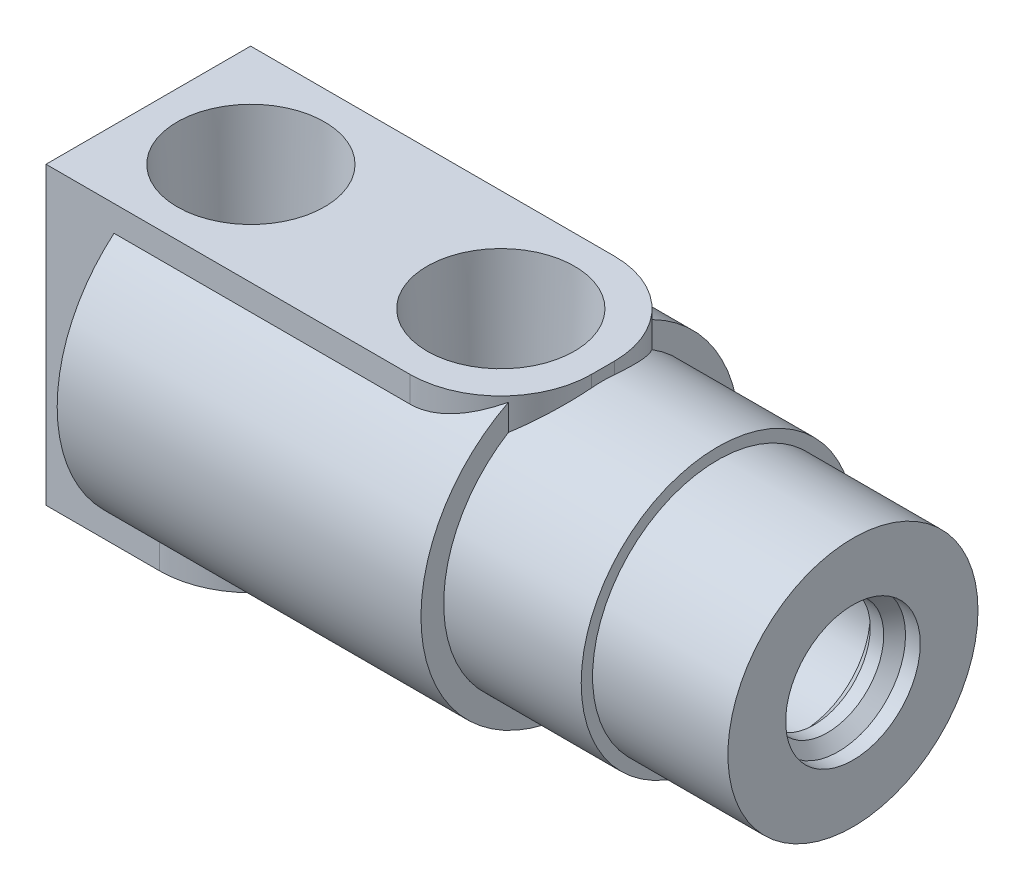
ISO-10303-21;
HEADER;
FILE_DESCRIPTION(('STEP AP214'),'2;1');
FILE_NAME('part.step','',(''),(''),'','','');
FILE_SCHEMA(('AUTOMOTIVE_DESIGN { 1 0 10303 214 1 1 1 1 }'));
ENDSEC;
DATA;
#1=APPLICATION_CONTEXT('core data for automotive mechanical design processes');
#2=APPLICATION_PROTOCOL_DEFINITION('international standard','automotive_design',2000,#1);
#3=PRODUCT_CONTEXT('',#1,'mechanical');
#4=PRODUCT('Part','Part','',(#3));
#5=PRODUCT_RELATED_PRODUCT_CATEGORY('part','',(#4));
#6=PRODUCT_DEFINITION_FORMATION('','',#4);
#7=PRODUCT_DEFINITION_CONTEXT('part definition',#1,'design');
#8=PRODUCT_DEFINITION('design','',#6,#7);
#9=PRODUCT_DEFINITION_SHAPE('','',#8);
#10=(LENGTH_UNIT() NAMED_UNIT(*) SI_UNIT(.MILLI.,.METRE.));
#11=(NAMED_UNIT(*) PLANE_ANGLE_UNIT() SI_UNIT($,.RADIAN.));
#12=(NAMED_UNIT(*) SI_UNIT($,.STERADIAN.) SOLID_ANGLE_UNIT());
#13=UNCERTAINTY_MEASURE_WITH_UNIT(LENGTH_MEASURE(1.E-05),#10,'distance_accuracy_value','');
#14=(GEOMETRIC_REPRESENTATION_CONTEXT(3) GLOBAL_UNCERTAINTY_ASSIGNED_CONTEXT((#13)) GLOBAL_UNIT_ASSIGNED_CONTEXT((#10,
#11,#12)) REPRESENTATION_CONTEXT('',''));
#15=CARTESIAN_POINT('',(0.,0.,0.));
#16=DIRECTION('',(0.,0.,1.));
#17=DIRECTION('',(1.,0.,0.));
#18=AXIS2_PLACEMENT_3D('',#15,#16,#17);
#19=CARTESIAN_POINT('',(-26.9446336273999,2.1335999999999,0.));
#20=DIRECTION('',(0.,-1.,0.));
#21=DIRECTION('',(0.,0.,-1.));
#22=AXIS2_PLACEMENT_3D('',#19,#20,#21);
#23=PLANE('',#22);
#24=CARTESIAN_POINT('',(-24.5872,2.13359999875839,0.));
#25=DIRECTION('',(0.,1.,0.));
#26=DIRECTION('',(0.,0.,1.));
#27=AXIS2_PLACEMENT_3D('',#24,#25,#26);
#28=CIRCLE('',#27,4.71486727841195);
#29=CARTESIAN_POINT('',(-20.4808339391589,2.13359999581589,-2.31683646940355));
#30=VERTEX_POINT('',#29);
#31=CARTESIAN_POINT('',(-28.6935660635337,2.13359999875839,-2.31683646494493));
#32=VERTEX_POINT('',#31);
#33=EDGE_CURVE('E195',#30,#32,#28,.T.);
#34=ORIENTED_EDGE('',*,*,#33,.T.);
#35=DIRECTION('',(1.,0.,0.));
#36=VECTOR('',#35,1.);
#37=CARTESIAN_POINT('',(-26.9446336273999,2.1335999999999,-2.31683646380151));
#38=LINE('',#37,#36);
#39=CARTESIAN_POINT('',(-26.7208,2.1335999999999,-2.31683646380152));
#40=VERTEX_POINT('',#39);
#41=EDGE_CURVE('E35',#40,#32,#38,.F.);
#42=ORIENTED_EDGE('',*,*,#41,.F.);
#43=CARTESIAN_POINT('',(-24.5872,2.1335999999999,0.));
#44=DIRECTION('',(0.,-1.,0.));
#45=DIRECTION('',(0.,0.,-1.));
#46=AXIS2_PLACEMENT_3D('',#43,#44,#45);
#47=CIRCLE('',#46,3.1496);
#48=CARTESIAN_POINT('',(-22.4536000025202,2.1335999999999,-2.31683646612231));
#49=VERTEX_POINT('',#48);
#50=EDGE_CURVE('E250',#49,#40,#47,.F.);
#51=ORIENTED_EDGE('',*,*,#50,.F.);
#52=DIRECTION('',(1.,0.,0.));
#53=VECTOR('',#52,1.);
#54=CARTESIAN_POINT('',(-26.9446336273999,2.1335999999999,-2.31683646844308));
#55=LINE('',#54,#53);
#56=EDGE_CURVE('E249',#30,#49,#55,.F.);
#57=ORIENTED_EDGE('',*,*,#56,.F.);
#58=EDGE_LOOP('',(#34,#42,#51,#57));
#59=FACE_BOUND('',#58,.T.);
#60=ADVANCED_FACE('F16',(#59),#23,.F.);
#61=DIRECTION('',(1.,0.,0.));
#62=VECTOR('',#61,1.);
#63=CARTESIAN_POINT('',(-26.9446336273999,2.1335999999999,2.31683646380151));
#64=LINE('',#63,#62);
#65=CARTESIAN_POINT('',(-28.6935660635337,2.13359999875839,2.31683646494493));
#66=VERTEX_POINT('',#65);
#67=CARTESIAN_POINT('',(-26.7208,2.1335999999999,2.31683646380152));
#68=VERTEX_POINT('',#67);
#69=EDGE_CURVE('E177',#66,#68,#64,.T.);
#70=ORIENTED_EDGE('',*,*,#69,.F.);
#71=CARTESIAN_POINT('',(-20.4808339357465,2.1335999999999,2.31683646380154));
#72=VERTEX_POINT('',#71);
#73=EDGE_CURVE('E181',#66,#72,#28,.T.);
#74=ORIENTED_EDGE('',*,*,#73,.T.);
#75=DIRECTION('',(1.,0.,0.));
#76=VECTOR('',#75,1.);
#77=CARTESIAN_POINT('',(-26.9446336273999,2.1335999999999,2.3168364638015));
#78=LINE('',#77,#76);
#79=CARTESIAN_POINT('',(-22.4536,2.1335999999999,2.31683646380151));
#80=VERTEX_POINT('',#79);
#81=EDGE_CURVE('E253',#80,#72,#78,.T.);
#82=ORIENTED_EDGE('',*,*,#81,.F.);
#83=CARTESIAN_POINT('',(-24.5872,2.1335999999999,0.));
#84=DIRECTION('',(0.,-1.,0.));
#85=DIRECTION('',(0.,0.,-1.));
#86=AXIS2_PLACEMENT_3D('',#83,#84,#85);
#87=CIRCLE('',#86,3.1496);
#88=EDGE_CURVE('E184',#68,#80,#87,.F.);
#89=ORIENTED_EDGE('',*,*,#88,.F.);
#90=EDGE_LOOP('',(#70,#74,#82,#89));
#91=FACE_BOUND('',#90,.T.);
#92=ADVANCED_FACE('F178',(#91),#23,.F.);
#93=CARTESIAN_POINT('',(-24.5872,10.3123999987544,0.));
#94=DIRECTION('',(0.,1.,0.));
#95=DIRECTION('',(0.,0.,1.));
#96=AXIS2_PLACEMENT_3D('',#93,#94,#95);
#97=CONICAL_SURFACE('',#96,5.14350002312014,0.0523598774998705);
#98=CARTESIAN_POINT('',(-24.5872,10.3123999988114,0.));
#99=DIRECTION('',(0.,1.,0.));
#100=DIRECTION('',(0.,0.,1.));
#101=AXIS2_PLACEMENT_3D('',#98,#99,#100);
#102=CIRCLE('',#101,5.14350002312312);
#103=CARTESIAN_POINT('',(-24.5872,10.3123999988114,5.14350002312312));
#104=VERTEX_POINT('',#103);
#105=EDGE_CURVE('E284',#104,#104,#102,.F.);
#106=ORIENTED_EDGE('',*,*,#105,.F.);
#107=EDGE_LOOP('',(#106));
#108=FACE_BOUND('',#107,.T.);
#109=CARTESIAN_POINT('',(-28.5677952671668,1.90939923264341,-2.50483027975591));
#110=CARTESIAN_POINT('',(-28.6060045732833,1.97992018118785,-2.45106024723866));
#111=CARTESIAN_POINT('',(-28.6442819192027,2.04816786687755,-2.39433837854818));
#112=CARTESIAN_POINT('',(-28.7202070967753,2.17986827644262,-2.27509745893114));
#113=CARTESIAN_POINT('',(-28.7578544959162,2.24331780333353,-2.21257460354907));
#114=CARTESIAN_POINT('',(-28.8320729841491,2.36569184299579,-2.08125252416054));
#115=CARTESIAN_POINT('',(-28.8686294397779,2.42456442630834,-2.01239649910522));
#116=CARTESIAN_POINT('',(-28.9394744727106,2.53664510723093,-1.86913935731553));
#117=CARTESIAN_POINT('',(-28.9737634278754,2.58985414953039,-1.79473916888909));
#118=CARTESIAN_POINT('',(-29.0394710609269,2.69038562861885,-1.64022644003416));
#119=CARTESIAN_POINT('',(-29.0708738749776,2.73767599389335,-1.56008618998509));
#120=CARTESIAN_POINT('',(-29.1298169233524,2.82545807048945,-1.39481821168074));
#121=CARTESIAN_POINT('',(-29.157357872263,2.86595103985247,-1.3096914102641));
#122=CARTESIAN_POINT('',(-29.2077185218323,2.93937449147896,-1.13532725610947));
#123=CARTESIAN_POINT('',(-29.2305572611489,2.97233553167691,-1.04610834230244));
#124=CARTESIAN_POINT('',(-29.2709564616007,3.03029208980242,-0.863965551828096));
#125=CARTESIAN_POINT('',(-29.2885182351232,3.05528958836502,-0.771042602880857));
#126=CARTESIAN_POINT('',(-29.3156692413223,3.09378994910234,-0.596047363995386));
#127=CARTESIAN_POINT('',(-29.3260435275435,3.10843141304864,-0.514345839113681));
#128=CARTESIAN_POINT('',(-29.3422349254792,3.13124093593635,-0.349604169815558));
#129=CARTESIAN_POINT('',(-29.3480527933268,3.1394100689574,-0.266564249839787));
#130=CARTESIAN_POINT('',(-29.3549716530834,3.14912223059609,-0.0998810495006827));
#131=CARTESIAN_POINT('',(-29.3560718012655,3.15066407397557,-0.0162376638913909));
#132=CARTESIAN_POINT('',(-29.3535304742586,3.14709834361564,0.150807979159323));
#133=CARTESIAN_POINT('',(-29.349889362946,3.14199128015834,0.234210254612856));
#134=CARTESIAN_POINT('',(-29.3334989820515,3.11895289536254,0.461693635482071));
#135=CARTESIAN_POINT('',(-29.3159930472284,3.09431338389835,0.604827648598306));
#136=CARTESIAN_POINT('',(-29.2681973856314,3.02637233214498,0.884174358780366));
#137=CARTESIAN_POINT('',(-29.2379109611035,2.98307561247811,1.02038883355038));
#138=CARTESIAN_POINT('',(-29.1651774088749,2.87754196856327,1.28896580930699));
#139=CARTESIAN_POINT('',(-29.1222632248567,2.81457043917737,1.42091057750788));
#140=CARTESIAN_POINT('',(-29.0276523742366,2.67268203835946,1.67262801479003));
#141=CARTESIAN_POINT('',(-28.9759434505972,2.5937428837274,1.79238331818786));
#142=CARTESIAN_POINT('',(-28.8661379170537,2.42106243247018,2.019656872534));
#143=CARTESIAN_POINT('',(-28.8079806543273,2.32717619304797,2.12703542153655));
#144=CARTESIAN_POINT('',(-28.7187578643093,2.17712526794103,2.277079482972));
#145=CARTESIAN_POINT('',(-28.6887370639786,2.12566404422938,2.32518637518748));
#146=CARTESIAN_POINT('',(-28.6283964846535,2.01975100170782,2.4177509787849));
#147=CARTESIAN_POINT('',(-28.5980767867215,1.96529997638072,2.46220965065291));
#148=CARTESIAN_POINT('',(-28.5677952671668,1.90939923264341,2.50483027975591));
#149=B_SPLINE_CURVE_WITH_KNOTS('',3,(#109,#110,#111,#112,#113,#114,#115,#116,#117,#118,#119,
#120,#121,#122,#123,#124,#125,#126,#127,#128,#129,#130,#131,#132,#133,#134,#135,#136,#137,#138,
#139,#140,#141,#142,#143,#144,#145,#146,#147,#148),.UNSPECIFIED.,.F.,.F.,(4,2,2,2,2,2,2,2,2,2,2,
2,2,2,2,2,2,2,2,4),(0.,0.28963295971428,0.579457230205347,0.872196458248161,1.16488678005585,
1.45910010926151,1.75325892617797,2.04620223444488,2.3390726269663,2.58965197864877,
2.84018973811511,3.09077230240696,3.34133563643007,3.77802521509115,4.21460203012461,
4.66995830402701,5.1259544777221,5.58667702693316,5.81628013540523,6.04582259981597),.UNSPECIFIED.);
#150=EDGE_CURVE('E10',#32,#66,#149,.T.);
#151=ORIENTED_EDGE('',*,*,#150,.F.);
#152=ORIENTED_EDGE('',*,*,#33,.F.);
#153=CARTESIAN_POINT('',(-20.4808334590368,2.13360062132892,2.31683630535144));
#154=CARTESIAN_POINT('',(-20.4447791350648,2.19577262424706,2.25955611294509));
#155=CARTESIAN_POINT('',(-20.4090845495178,2.25573514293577,2.19972941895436));
#156=CARTESIAN_POINT('',(-20.3390055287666,2.3710326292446,2.07495661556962));
#157=CARTESIAN_POINT('',(-20.3046222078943,2.42636370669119,2.01000628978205));
#158=CARTESIAN_POINT('',(-20.2037936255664,2.5859321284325,1.80632126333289));
#159=CARTESIAN_POINT('',(-20.1403662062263,2.68257373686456,1.65982161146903));
#160=CARTESIAN_POINT('',(-20.0552889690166,2.80960481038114,1.42620406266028));
#161=CARTESIAN_POINT('',(-20.0285299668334,2.84906826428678,1.34570798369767));
#162=CARTESIAN_POINT('',(-19.9791026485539,2.92134701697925,1.18059923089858));
#163=CARTESIAN_POINT('',(-19.9564316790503,2.95416662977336,1.09598927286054));
#164=CARTESIAN_POINT('',(-19.9159051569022,3.01247207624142,0.923699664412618));
#165=CARTESIAN_POINT('',(-19.8980240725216,3.03799684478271,0.836039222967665));
#166=CARTESIAN_POINT('',(-19.8674526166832,3.08145626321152,0.658020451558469));
#167=CARTESIAN_POINT('',(-19.8547586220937,3.09939621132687,0.567664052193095));
#168=CARTESIAN_POINT('',(-19.836339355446,3.12536866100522,0.39793901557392));
#169=CARTESIAN_POINT('',(-19.8298865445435,3.13443761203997,0.318806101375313));
#170=CARTESIAN_POINT('',(-19.8212585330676,3.1465554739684,0.159781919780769));
#171=CARTESIAN_POINT('',(-19.8190865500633,3.14959985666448,0.0798901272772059));
#172=CARTESIAN_POINT('',(-19.8190862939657,3.14960014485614,-0.0778289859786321));
#173=CARTESIAN_POINT('',(-19.8211474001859,3.14671110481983,-0.155656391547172));
#174=CARTESIAN_POINT('',(-19.8293425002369,3.13520212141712,-0.31069847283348));
#175=CARTESIAN_POINT('',(-19.8354780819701,3.12657994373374,-0.387912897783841));
#176=CARTESIAN_POINT('',(-19.8516872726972,3.10372977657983,-0.541151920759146));
#177=CARTESIAN_POINT('',(-19.8617640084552,3.08949733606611,-0.617175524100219));
#178=CARTESIAN_POINT('',(-19.8856232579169,3.05564569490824,-0.767431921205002));
#179=CARTESIAN_POINT('',(-19.8994073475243,3.03602420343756,-0.841663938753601));
#180=CARTESIAN_POINT('',(-19.9457044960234,2.96974297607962,-1.05999712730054));
#181=CARTESIAN_POINT('',(-19.9832823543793,2.91550102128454,-1.20081100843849));
#182=CARTESIAN_POINT('',(-20.0691852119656,2.78916674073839,-1.47064674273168));
#183=CARTESIAN_POINT('',(-20.1175221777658,2.71705452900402,-1.59965523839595));
#184=CARTESIAN_POINT('',(-20.2169427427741,2.56487111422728,-1.83274410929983));
#185=CARTESIAN_POINT('',(-20.267345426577,2.48617728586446,-1.93802754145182));
#186=CARTESIAN_POINT('',(-20.3718549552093,2.31781224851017,-2.13647928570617));
#187=CARTESIAN_POINT('',(-20.4259444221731,2.22819115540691,-2.22969914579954));
#188=CARTESIAN_POINT('',(-20.4808339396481,2.13359999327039,-2.31683646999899));
#189=B_SPLINE_CURVE_WITH_KNOTS('',3,(#153,#154,#155,#156,#157,#158,#159,#160,#161,#162,#163,
#164,#165,#166,#167,#168,#169,#170,#171,#172,#173,#174,#175,#176,#177,#178,#179,#180,#181,#182,
#183,#184,#185,#186,#187,#188),.UNSPECIFIED.,.F.,.F.,(4,2,2,2,2,2,2,2,2,2,2,2,2,2,2,2,2,4),(0.,
0.275540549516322,0.551310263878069,1.10799250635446,1.38834086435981,1.6685065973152,
1.94714781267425,2.22559406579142,2.46499908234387,2.70458397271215,2.9379876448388,
3.17148233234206,3.40516264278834,3.63894244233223,4.10326029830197,4.56809718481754,
4.98941145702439,5.40886140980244),.UNSPECIFIED.);
#190=EDGE_CURVE('E193',#72,#30,#189,.T.);
#191=ORIENTED_EDGE('',*,*,#190,.F.);
#192=ORIENTED_EDGE('',*,*,#73,.F.);
#193=EDGE_LOOP('',(#151,#152,#191,#192));
#194=FACE_BOUND('',#193,.T.);
#195=ADVANCED_FACE('F192',(#108,#194),#97,.F.);
#196=CARTESIAN_POINT('',(-40.6324710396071,0.,0.));
#197=DIRECTION('',(-1.,0.,0.));
#198=DIRECTION('',(0.,0.,1.));
#199=AXIS2_PLACEMENT_3D('',#196,#197,#198);
#200=CYLINDRICAL_SURFACE('',#199,2.13360000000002);
#201=CARTESIAN_POINT('',(-42.037,0.,0.));
#202=DIRECTION('',(-0.707106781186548,-0.707106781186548,0.));
#203=DIRECTION('',(0.707106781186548,-0.707106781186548,0.));
#204=AXIS2_PLACEMENT_3D('',#201,#202,#203);
#205=ELLIPSE('',#204,3.01736605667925,2.1336);
#206=CARTESIAN_POINT('',(-42.037,0.,2.1336));
#207=VERTEX_POINT('',#206);
#208=CARTESIAN_POINT('',(-39.9034,-2.1336,0.));
#209=VERTEX_POINT('',#208);
#210=EDGE_CURVE('E292',#207,#209,#205,.F.);
#211=ORIENTED_EDGE('',*,*,#210,.F.);
#212=CARTESIAN_POINT('',(-42.037,0.,0.));
#213=DIRECTION('',(0.707106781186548,-0.707106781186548,0.));
#214=DIRECTION('',(-0.707106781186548,-0.707106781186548,0.));
#215=AXIS2_PLACEMENT_3D('',#212,#213,#214);
#216=ELLIPSE('',#215,3.01736605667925,2.1336);
#217=CARTESIAN_POINT('',(-39.9034,2.1335999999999,0.));
#218=VERTEX_POINT('',#217);
#219=EDGE_CURVE('E609',#218,#207,#216,.T.);
#220=ORIENTED_EDGE('',*,*,#219,.F.);
#221=CARTESIAN_POINT('',(-42.037,0.,0.));
#222=DIRECTION('',(0.707106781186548,-0.707106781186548,0.));
#223=DIRECTION('',(-0.707106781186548,-0.707106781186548,0.));
#224=AXIS2_PLACEMENT_3D('',#221,#222,#223);
#225=ELLIPSE('',#224,3.01736605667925,2.1336);
#226=CARTESIAN_POINT('',(-42.037,0.,-2.13360000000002));
#227=VERTEX_POINT('',#226);
#228=EDGE_CURVE('E607',#227,#218,#225,.T.);
#229=ORIENTED_EDGE('',*,*,#228,.F.);
#230=CARTESIAN_POINT('',(-42.037,0.,0.));
#231=DIRECTION('',(-0.707106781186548,-0.707106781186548,0.));
#232=DIRECTION('',(0.707106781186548,-0.707106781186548,0.));
#233=AXIS2_PLACEMENT_3D('',#230,#231,#232);
#234=ELLIPSE('',#233,3.01736605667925,2.1336);
#235=EDGE_CURVE('E290',#209,#227,#234,.F.);
#236=ORIENTED_EDGE('',*,*,#235,.F.);
#237=EDGE_LOOP('',(#211,#220,#229,#236));
#238=FACE_BOUND('',#237,.T.);
#239=CARTESIAN_POINT('',(-30.2308737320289,0.,0.));
#240=DIRECTION('',(1.,0.,0.));
#241=DIRECTION('',(0.,0.,-1.));
#242=AXIS2_PLACEMENT_3D('',#239,#240,#241);
#243=CIRCLE('',#242,2.13360000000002);
#244=CARTESIAN_POINT('',(-30.2308737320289,0.,-2.13360000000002));
#245=VERTEX_POINT('',#244);
#246=EDGE_CURVE('E487',#245,#245,#243,.F.);
#247=ORIENTED_EDGE('',*,*,#246,.F.);
#248=EDGE_LOOP('',(#247));
#249=FACE_BOUND('',#248,.T.);
#250=ADVANCED_FACE('F216',(#238,#249),#200,.F.);
#251=CARTESIAN_POINT('',(-6.44613890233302,0.,0.));
#252=DIRECTION('',(1.,0.,0.));
#253=DIRECTION('',(0.,0.,-1.));
#254=AXIS2_PLACEMENT_3D('',#251,#252,#253);
#255=CYLINDRICAL_SURFACE('',#254,4.699);
#256=CARTESIAN_POINT('',(-3.49346583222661,0.,0.));
#257=DIRECTION('',(-1.,0.,0.));
#258=DIRECTION('',(0.,0.,1.));
#259=AXIS2_PLACEMENT_3D('',#256,#257,#258);
#260=CIRCLE('',#259,4.69900001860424);
#261=CARTESIAN_POINT('',(-3.49346583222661,0.,4.69900001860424));
#262=VERTEX_POINT('',#261);
#263=EDGE_CURVE('E384',#262,#262,#260,.F.);
#264=ORIENTED_EDGE('',*,*,#263,.T.);
#265=EDGE_LOOP('',(#264));
#266=FACE_BOUND('',#265,.T.);
#267=CARTESIAN_POINT('',(-9.398811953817,0.,0.));
#268=DIRECTION('',(1.,0.,0.));
#269=DIRECTION('',(0.,0.,-1.));
#270=AXIS2_PLACEMENT_3D('',#267,#268,#269);
#271=CIRCLE('',#270,4.699);
#272=CARTESIAN_POINT('',(-9.398811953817,0.,-4.699));
#273=VERTEX_POINT('',#272);
#274=EDGE_CURVE('E570',#273,#273,#271,.F.);
#275=ORIENTED_EDGE('',*,*,#274,.T.);
#276=EDGE_LOOP('',(#275));
#277=FACE_BOUND('',#276,.T.);
#278=ADVANCED_FACE('F358',(#266,#277),#255,.F.);
#279=CARTESIAN_POINT('',(-3.4934658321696,0.,0.));
#280=DIRECTION('',(-1.,0.,0.));
#281=DIRECTION('',(0.,0.,1.));
#282=AXIS2_PLACEMENT_3D('',#279,#280,#281);
#283=CONICAL_SURFACE('',#282,4.6990000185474,0.785398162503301);
#284=CARTESIAN_POINT('',(-2.73059137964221,0.,0.));
#285=DIRECTION('',(1.,0.,0.));
#286=DIRECTION('',(0.,0.,-1.));
#287=AXIS2_PLACEMENT_3D('',#284,#285,#286);
#288=CIRCLE('',#287,3.93612552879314);
#289=CARTESIAN_POINT('',(-2.73059137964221,0.,-3.93612552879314));
#290=VERTEX_POINT('',#289);
#291=EDGE_CURVE('E573',#290,#290,#288,.T.);
#292=ORIENTED_EDGE('',*,*,#291,.T.);
#293=EDGE_LOOP('',(#292));
#294=FACE_BOUND('',#293,.T.);
#295=ORIENTED_EDGE('',*,*,#263,.F.);
#296=EDGE_LOOP('',(#295));
#297=FACE_BOUND('',#296,.T.);
#298=ADVANCED_FACE('F659',(#294,#297),#283,.F.);
#299=CARTESIAN_POINT('',(-45.8109597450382,1.06679999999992,0.));
#300=DIRECTION('',(-1.,0.,0.));
#301=DIRECTION('',(0.,0.,1.));
#302=AXIS2_PLACEMENT_3D('',#299,#300,#301);
#303=PLANE('',#302);
#304=CARTESIAN_POINT('',(-45.8109597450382,0.,0.));
#305=DIRECTION('',(-1.,0.,0.));
#306=DIRECTION('',(0.,0.,1.));
#307=AXIS2_PLACEMENT_3D('',#304,#305,#306);
#308=CIRCLE('',#307,2.13360000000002);
#309=CARTESIAN_POINT('',(-45.8109597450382,0.,2.13360000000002));
#310=VERTEX_POINT('',#309);
#311=EDGE_CURVE('E579',#310,#310,#308,.F.);
#312=ORIENTED_EDGE('',*,*,#311,.T.);
#313=EDGE_LOOP('',(#312));
#314=FACE_BOUND('',#313,.T.);
#315=ADVANCED_FACE('F657',(#314),#303,.F.);
#316=CARTESIAN_POINT('',(-9.398811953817,2.34949999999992,0.));
#317=DIRECTION('',(-1.,0.,0.));
#318=DIRECTION('',(0.,0.,1.));
#319=AXIS2_PLACEMENT_3D('',#316,#317,#318);
#320=PLANE('',#319);
#321=ORIENTED_EDGE('',*,*,#274,.F.);
#322=EDGE_LOOP('',(#321));
#323=FACE_BOUND('',#322,.T.);
#324=CARTESIAN_POINT('',(-9.3988119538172,0.,0.));
#325=DIRECTION('',(-1.,0.,0.));
#326=DIRECTION('',(0.,0.,1.));
#327=AXIS2_PLACEMENT_3D('',#324,#325,#326);
#328=CIRCLE('',#327,3.14960000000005);
#329=CARTESIAN_POINT('',(-9.3988119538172,0.,3.14960000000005));
#330=VERTEX_POINT('',#329);
#331=EDGE_CURVE('E256',#330,#330,#328,.T.);
#332=ORIENTED_EDGE('',*,*,#331,.T.);
#333=EDGE_LOOP('',(#332));
#334=FACE_BOUND('',#333,.T.);
#335=ADVANCED_FACE('F18',(#323,#334),#320,.F.);
#336=CARTESIAN_POINT('',(-24.5872,2.1335999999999,0.));
#337=DIRECTION('',(0.,-1.,0.));
#338=DIRECTION('',(0.,0.,-1.));
#339=AXIS2_PLACEMENT_3D('',#336,#337,#338);
#340=CYLINDRICAL_SURFACE('',#339,3.1496);
#341=ORIENTED_EDGE('',*,*,#50,.T.);
#342=CARTESIAN_POINT('',(-24.5872,0.,0.));
#343=DIRECTION('',(-0.707106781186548,-0.707106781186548,0.));
#344=DIRECTION('',(0.707106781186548,-0.707106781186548,0.));
#345=AXIS2_PLACEMENT_3D('',#342,#343,#344);
#346=ELLIPSE('',#345,4.45420703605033,3.1496);
#347=CARTESIAN_POINT('',(-24.5872,-6.73816002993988E-08,-3.14960000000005));
#348=VERTEX_POINT('',#347);
#349=EDGE_CURVE('E587',#40,#348,#346,.T.);
#350=ORIENTED_EDGE('',*,*,#349,.T.);
#351=CARTESIAN_POINT('',(-24.5872,0.,0.));
#352=DIRECTION('',(0.707106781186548,-0.707106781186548,0.));
#353=DIRECTION('',(-0.707106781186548,-0.707106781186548,0.));
#354=AXIS2_PLACEMENT_3D('',#351,#352,#353);
#355=ELLIPSE('',#354,4.45420703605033,3.1496);
#356=EDGE_CURVE('E597',#348,#49,#355,.T.);
#357=ORIENTED_EDGE('',*,*,#356,.T.);
#358=EDGE_LOOP('',(#341,#350,#357));
#359=FACE_BOUND('',#358,.T.);
#360=ADVANCED_FACE('F652',(#359),#340,.F.);
#361=CARTESIAN_POINT('',(-24.5872,2.1335999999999,0.));
#362=DIRECTION('',(0.,-1.,0.));
#363=DIRECTION('',(0.,0.,-1.));
#364=AXIS2_PLACEMENT_3D('',#361,#362,#363);
#365=CYLINDRICAL_SURFACE('',#364,3.1496);
#366=ORIENTED_EDGE('',*,*,#88,.T.);
#367=CARTESIAN_POINT('',(-24.5872,0.,0.));
#368=DIRECTION('',(0.707106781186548,-0.707106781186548,0.));
#369=DIRECTION('',(-0.707106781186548,-0.707106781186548,0.));
#370=AXIS2_PLACEMENT_3D('',#367,#368,#369);
#371=ELLIPSE('',#370,4.45420703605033,3.1496);
#372=CARTESIAN_POINT('',(-24.5872,0.,3.14960000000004));
#373=VERTEX_POINT('',#372);
#374=EDGE_CURVE('E565',#80,#373,#371,.T.);
#375=ORIENTED_EDGE('',*,*,#374,.T.);
#376=CARTESIAN_POINT('',(-24.5872,0.,0.));
#377=DIRECTION('',(-0.707106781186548,-0.707106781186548,0.));
#378=DIRECTION('',(0.707106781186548,-0.707106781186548,0.));
#379=AXIS2_PLACEMENT_3D('',#376,#377,#378);
#380=ELLIPSE('',#379,4.45420703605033,3.1496);
#381=EDGE_CURVE('E589',#373,#68,#380,.T.);
#382=ORIENTED_EDGE('',*,*,#381,.T.);
#383=EDGE_LOOP('',(#366,#375,#382));
#384=FACE_BOUND('',#383,.T.);
#385=ADVANCED_FACE('F644',(#384),#365,.F.);
#386=CARTESIAN_POINT('',(-1.28877937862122,0.,0.));
#387=DIRECTION('',(1.,0.,0.));
#388=DIRECTION('',(0.,0.,-1.));
#389=AXIS2_PLACEMENT_3D('',#386,#387,#388);
#390=CYLINDRICAL_SURFACE('',#389,3.93612552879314);
#391=ORIENTED_EDGE('',*,*,#291,.F.);
#392=EDGE_LOOP('',(#391));
#393=FACE_BOUND('',#392,.T.);
#394=CARTESIAN_POINT('',(-1.79006741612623,0.,0.));
#395=DIRECTION('',(1.,0.,0.));
#396=DIRECTION('',(0.,1.,0.));
#397=AXIS2_PLACEMENT_3D('',#394,#395,#396);
#398=CIRCLE('',#397,3.93612552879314);
#399=CARTESIAN_POINT('',(-1.79006741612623,3.93612552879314,0.));
#400=VERTEX_POINT('',#399);
#401=EDGE_CURVE('E566',#400,#400,#398,.T.);
#402=ORIENTED_EDGE('',*,*,#401,.T.);
#403=EDGE_LOOP('',(#402));
#404=FACE_BOUND('',#403,.T.);
#405=ADVANCED_FACE('F635',(#393,#404),#390,.F.);
#406=CARTESIAN_POINT('',(-40.6324710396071,0.,0.));
#407=DIRECTION('',(-1.,0.,0.));
#408=DIRECTION('',(0.,0.,1.));
#409=AXIS2_PLACEMENT_3D('',#406,#407,#408);
#410=CYLINDRICAL_SURFACE('',#409,2.13360000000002);
#411=ORIENTED_EDGE('',*,*,#311,.F.);
#412=EDGE_LOOP('',(#411));
#413=FACE_BOUND('',#412,.T.);
#414=CARTESIAN_POINT('',(-42.037,0.,0.));
#415=DIRECTION('',(-0.707106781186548,0.707106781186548,0.));
#416=DIRECTION('',(-0.707106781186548,-0.707106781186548,0.));
#417=AXIS2_PLACEMENT_3D('',#414,#415,#416);
#418=ELLIPSE('',#417,3.01736605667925,2.1336);
#419=CARTESIAN_POINT('',(-44.1706,-2.1336,0.));
#420=VERTEX_POINT('',#419);
#421=EDGE_CURVE('E583',#420,#227,#418,.F.);
#422=ORIENTED_EDGE('',*,*,#421,.T.);
#423=CARTESIAN_POINT('',(-42.037,0.,0.));
#424=DIRECTION('',(-0.707106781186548,-0.707106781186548,0.));
#425=DIRECTION('',(-0.707106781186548,0.707106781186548,0.));
#426=AXIS2_PLACEMENT_3D('',#423,#424,#425);
#427=ELLIPSE('',#426,3.01736605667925,2.1336);
#428=CARTESIAN_POINT('',(-44.1706,2.1335999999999,0.));
#429=VERTEX_POINT('',#428);
#430=EDGE_CURVE('E574',#227,#429,#427,.F.);
#431=ORIENTED_EDGE('',*,*,#430,.T.);
#432=CARTESIAN_POINT('',(-42.037,0.,0.));
#433=DIRECTION('',(-0.707106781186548,-0.707106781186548,0.));
#434=DIRECTION('',(-0.707106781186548,0.707106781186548,0.));
#435=AXIS2_PLACEMENT_3D('',#432,#433,#434);
#436=ELLIPSE('',#435,3.01736605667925,2.1336);
#437=EDGE_CURVE('E585',#429,#207,#436,.F.);
#438=ORIENTED_EDGE('',*,*,#437,.T.);
#439=CARTESIAN_POINT('',(-42.037,0.,0.));
#440=DIRECTION('',(-0.707106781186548,0.707106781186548,0.));
#441=DIRECTION('',(-0.707106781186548,-0.707106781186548,0.));
#442=AXIS2_PLACEMENT_3D('',#439,#440,#441);
#443=ELLIPSE('',#442,3.01736605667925,2.1336);
#444=EDGE_CURVE('E569',#207,#420,#443,.F.);
#445=ORIENTED_EDGE('',*,*,#444,.T.);
#446=EDGE_LOOP('',(#422,#431,#438,#445));
#447=FACE_BOUND('',#446,.T.);
#448=ADVANCED_FACE('F633',(#413,#447),#410,.F.);
#449=CARTESIAN_POINT('',(-42.037,2.1335999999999,0.));
#450=DIRECTION('',(0.,-1.,0.));
#451=DIRECTION('',(0.,0.,-1.));
#452=AXIS2_PLACEMENT_3D('',#449,#450,#451);
#453=CYLINDRICAL_SURFACE('',#452,2.1336);
#454=ORIENTED_EDGE('',*,*,#228,.T.);
#455=CARTESIAN_POINT('',(-42.037,2.1335999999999,0.));
#456=DIRECTION('',(0.,-1.,0.));
#457=DIRECTION('',(0.,0.,-1.));
#458=AXIS2_PLACEMENT_3D('',#455,#456,#457);
#459=CIRCLE('',#458,2.1336);
#460=EDGE_CURVE('E591',#218,#429,#459,.F.);
#461=ORIENTED_EDGE('',*,*,#460,.T.);
#462=ORIENTED_EDGE('',*,*,#430,.F.);
#463=EDGE_LOOP('',(#454,#461,#462));
#464=FACE_BOUND('',#463,.T.);
#465=ADVANCED_FACE('F630',(#464),#453,.F.);
#466=CARTESIAN_POINT('',(-42.037,2.1335999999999,0.));
#467=DIRECTION('',(0.,-1.,0.));
#468=DIRECTION('',(0.,0.,-1.));
#469=AXIS2_PLACEMENT_3D('',#466,#467,#468);
#470=CYLINDRICAL_SURFACE('',#469,2.1336);
#471=ORIENTED_EDGE('',*,*,#219,.T.);
#472=ORIENTED_EDGE('',*,*,#437,.F.);
#473=CARTESIAN_POINT('',(-42.037,2.1335999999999,0.));
#474=DIRECTION('',(0.,-1.,0.));
#475=DIRECTION('',(0.,0.,-1.));
#476=AXIS2_PLACEMENT_3D('',#473,#474,#475);
#477=CIRCLE('',#476,2.1336);
#478=EDGE_CURVE('E594',#429,#218,#477,.F.);
#479=ORIENTED_EDGE('',*,*,#478,.T.);
#480=EDGE_LOOP('',(#471,#472,#479));
#481=FACE_BOUND('',#480,.T.);
#482=ADVANCED_FACE('F623',(#481),#470,.F.);
#483=CARTESIAN_POINT('',(-44.3944336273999,2.1335999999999,0.));
#484=DIRECTION('',(0.,-1.,0.));
#485=DIRECTION('',(0.,0.,-1.));
#486=AXIS2_PLACEMENT_3D('',#483,#484,#485);
#487=PLANE('',#486);
#488=CARTESIAN_POINT('',(-42.037,2.13359999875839,0.));
#489=DIRECTION('',(0.,1.,0.));
#490=DIRECTION('',(0.,0.,1.));
#491=AXIS2_PLACEMENT_3D('',#488,#489,#490);
#492=CIRCLE('',#491,4.71486727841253);
#493=CARTESIAN_POINT('',(-42.037,2.13359999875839,4.71486727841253));
#494=VERTEX_POINT('',#493);
#495=EDGE_CURVE('E198',#494,#494,#492,.T.);
#496=ORIENTED_EDGE('',*,*,#495,.T.);
#497=EDGE_LOOP('',(#496));
#498=FACE_BOUND('',#497,.T.);
#499=ORIENTED_EDGE('',*,*,#460,.F.);
#500=ORIENTED_EDGE('',*,*,#478,.F.);
#501=EDGE_LOOP('',(#499,#500));
#502=FACE_BOUND('',#501,.T.);
#503=ADVANCED_FACE('F617',(#498,#502),#487,.F.);
#504=CARTESIAN_POINT('',(-14.1742298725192,0.,0.));
#505=DIRECTION('',(-1.,0.,0.));
#506=DIRECTION('',(0.,0.,1.));
#507=AXIS2_PLACEMENT_3D('',#504,#505,#506);
#508=CYLINDRICAL_SURFACE('',#507,3.14960000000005);
#509=ORIENTED_EDGE('',*,*,#331,.F.);
#510=EDGE_LOOP('',(#509));
#511=FACE_BOUND('',#510,.T.);
#512=ORIENTED_EDGE('',*,*,#41,.T.);
#513=ORIENTED_EDGE('',*,*,#150,.T.);
#514=ORIENTED_EDGE('',*,*,#69,.T.);
#515=ORIENTED_EDGE('',*,*,#381,.F.);
#516=ORIENTED_EDGE('',*,*,#374,.F.);
#517=ORIENTED_EDGE('',*,*,#81,.T.);
#518=ORIENTED_EDGE('',*,*,#190,.T.);
#519=ORIENTED_EDGE('',*,*,#56,.T.);
#520=ORIENTED_EDGE('',*,*,#356,.F.);
#521=ORIENTED_EDGE('',*,*,#349,.F.);
#522=EDGE_LOOP('',(#512,#513,#514,#515,#516,#517,#518,#519,#520,#521));
#523=FACE_BOUND('',#522,.T.);
#524=CARTESIAN_POINT('',(-30.2308737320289,0.,0.));
#525=DIRECTION('',(1.,0.,0.));
#526=DIRECTION('',(0.,0.,-1.));
#527=AXIS2_PLACEMENT_3D('',#524,#525,#526);
#528=CIRCLE('',#527,3.14960000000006);
#529=CARTESIAN_POINT('',(-30.2308737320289,0.,-3.14960000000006));
#530=VERTEX_POINT('',#529);
#531=EDGE_CURVE('E555',#530,#530,#528,.T.);
#532=ORIENTED_EDGE('',*,*,#531,.F.);
#533=EDGE_LOOP('',(#532));
#534=FACE_BOUND('',#533,.T.);
#535=ADVANCED_FACE('F187',(#511,#523,#534),#508,.F.);
#536=CARTESIAN_POINT('',(-37.3221327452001,-2.1336,0.));
#537=DIRECTION('',(0.,1.,0.));
#538=DIRECTION('',(0.,0.,1.));
#539=AXIS2_PLACEMENT_3D('',#536,#537,#538);
#540=PLANE('',#539);
#541=CARTESIAN_POINT('',(-42.037,-2.13359999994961,1.20129600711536E-13));
#542=DIRECTION('',(0.,-1.,0.));
#543=DIRECTION('',(1.,0.,0.));
#544=AXIS2_PLACEMENT_3D('',#541,#542,#543);
#545=CIRCLE('',#544,4.71486725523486);
#546=CARTESIAN_POINT('',(-37.3221327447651,-2.13359999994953,1.20129600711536E-13));
#547=VERTEX_POINT('',#546);
#548=EDGE_CURVE('E201',#547,#547,#545,.T.);
#549=ORIENTED_EDGE('',*,*,#548,.T.);
#550=EDGE_LOOP('',(#549));
#551=FACE_BOUND('',#550,.T.);
#552=CARTESIAN_POINT('',(-42.037,-2.1336,0.));
#553=DIRECTION('',(0.,-1.,0.));
#554=DIRECTION('',(0.,0.,-1.));
#555=AXIS2_PLACEMENT_3D('',#552,#553,#554);
#556=CIRCLE('',#555,2.1336);
#557=EDGE_CURVE('E605',#209,#420,#556,.F.);
#558=ORIENTED_EDGE('',*,*,#557,.T.);
#559=CARTESIAN_POINT('',(-42.037,-2.1336,0.));
#560=DIRECTION('',(0.,-1.,0.));
#561=DIRECTION('',(0.,0.,-1.));
#562=AXIS2_PLACEMENT_3D('',#559,#560,#561);
#563=CIRCLE('',#562,2.1336);
#564=EDGE_CURVE('E603',#420,#209,#563,.F.);
#565=ORIENTED_EDGE('',*,*,#564,.T.);
#566=EDGE_LOOP('',(#558,#565));
#567=FACE_BOUND('',#566,.T.);
#568=ADVANCED_FACE('F236',(#551,#567),#540,.F.);
#569=CARTESIAN_POINT('',(-1.02719290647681,0.,0.));
#570=DIRECTION('',(1.,0.,0.));
#571=DIRECTION('',(0.,1.,0.));
#572=AXIS2_PLACEMENT_3D('',#569,#570,#571);
#573=CONICAL_SURFACE('',#572,4.69900003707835,0.785398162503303);
#574=ORIENTED_EDGE('',*,*,#401,.F.);
#575=EDGE_LOOP('',(#574));
#576=FACE_BOUND('',#575,.T.);
#577=CARTESIAN_POINT('',(-1.02719290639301,0.,0.));
#578=DIRECTION('',(1.,0.,0.));
#579=DIRECTION('',(0.,0.,-1.));
#580=AXIS2_PLACEMENT_3D('',#577,#578,#579);
#581=CIRCLE('',#580,4.69899999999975);
#582=CARTESIAN_POINT('',(-1.02719290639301,0.,-4.69899999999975));
#583=VERTEX_POINT('',#582);
#584=EDGE_CURVE('E299',#583,#583,#581,.T.);
#585=ORIENTED_EDGE('',*,*,#584,.T.);
#586=EDGE_LOOP('',(#585));
#587=FACE_BOUND('',#586,.T.);
#588=ADVANCED_FACE('F232',(#576,#587),#573,.F.);
#589=CARTESIAN_POINT('',(-42.037,2.1335999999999,0.));
#590=DIRECTION('',(0.,-1.,0.));
#591=DIRECTION('',(0.,0.,-1.));
#592=AXIS2_PLACEMENT_3D('',#589,#590,#591);
#593=CYLINDRICAL_SURFACE('',#592,2.1336);
#594=ORIENTED_EDGE('',*,*,#444,.F.);
#595=ORIENTED_EDGE('',*,*,#210,.T.);
#596=ORIENTED_EDGE('',*,*,#564,.F.);
#597=EDGE_LOOP('',(#594,#595,#596));
#598=FACE_BOUND('',#597,.T.);
#599=ADVANCED_FACE('F228',(#598),#593,.F.);
#600=CARTESIAN_POINT('',(-42.037,2.1335999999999,0.));
#601=DIRECTION('',(0.,-1.,0.));
#602=DIRECTION('',(0.,0.,-1.));
#603=AXIS2_PLACEMENT_3D('',#600,#601,#602);
#604=CYLINDRICAL_SURFACE('',#603,2.1336);
#605=ORIENTED_EDGE('',*,*,#235,.T.);
#606=ORIENTED_EDGE('',*,*,#421,.F.);
#607=ORIENTED_EDGE('',*,*,#557,.F.);
#608=EDGE_LOOP('',(#605,#606,#607));
#609=FACE_BOUND('',#608,.T.);
#610=ADVANCED_FACE('F224',(#609),#604,.F.);
#611=CARTESIAN_POINT('',(-42.037,10.3123999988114,0.));
#612=DIRECTION('',(0.,1.,0.));
#613=DIRECTION('',(0.,0.,1.));
#614=AXIS2_PLACEMENT_3D('',#611,#612,#613);
#615=CONICAL_SURFACE('',#614,5.14350002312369,0.0523598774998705);
#616=ORIENTED_EDGE('',*,*,#495,.F.);
#617=EDGE_LOOP('',(#616));
#618=FACE_BOUND('',#617,.T.);
#619=CARTESIAN_POINT('',(-42.037,10.3123999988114,0.));
#620=DIRECTION('',(0.,1.,0.));
#621=DIRECTION('',(0.,0.,1.));
#622=AXIS2_PLACEMENT_3D('',#619,#620,#621);
#623=CIRCLE('',#622,5.14350002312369);
#624=CARTESIAN_POINT('',(-42.037,10.3123999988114,5.14350002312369));
#625=VERTEX_POINT('',#624);
#626=EDGE_CURVE('E287',#625,#625,#623,.F.);
#627=ORIENTED_EDGE('',*,*,#626,.F.);
#628=EDGE_LOOP('',(#627));
#629=FACE_BOUND('',#628,.T.);
#630=ADVANCED_FACE('F220',(#618,#629),#615,.F.);
#631=CARTESIAN_POINT('',(-17.4498,10.3124,7.14375));
#632=DIRECTION('',(1.,0.,0.));
#633=DIRECTION('',(0.,0.,-1.));
#634=AXIS2_PLACEMENT_3D('',#631,#632,#633);
#635=PLANE('',#634);
#636=CARTESIAN_POINT('',(-17.4498,0.,0.));
#637=DIRECTION('',(1.,0.,0.));
#638=DIRECTION('',(0.,0.,-1.));
#639=AXIS2_PLACEMENT_3D('',#636,#637,#638);
#640=CIRCLE('',#639,9.525);
#641=CARTESIAN_POINT('',(-17.4498,9.49186946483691,-0.79375));
#642=VERTEX_POINT('',#641);
#643=CARTESIAN_POINT('',(-17.4498,9.49186946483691,0.79375));
#644=VERTEX_POINT('',#643);
#645=EDGE_CURVE('E483',#642,#644,#640,.T.);
#646=ORIENTED_EDGE('',*,*,#645,.F.);
#647=DIRECTION('',(0.,-1.,0.));
#648=VECTOR('',#647,1.);
#649=CARTESIAN_POINT('',(-17.4498,10.3124,-0.79375));
#650=LINE('',#649,#648);
#651=CARTESIAN_POINT('',(-17.4498,10.3124,-0.79375));
#652=VERTEX_POINT('',#651);
#653=EDGE_CURVE('E275',#652,#642,#650,.T.);
#654=ORIENTED_EDGE('',*,*,#653,.F.);
#655=DIRECTION('',(0.,0.,1.));
#656=VECTOR('',#655,1.);
#657=CARTESIAN_POINT('',(-17.4498,10.3124,0.));
#658=LINE('',#657,#656);
#659=CARTESIAN_POINT('',(-17.4498,10.3124,0.79375));
#660=VERTEX_POINT('',#659);
#661=EDGE_CURVE('E283',#660,#652,#658,.F.);
#662=ORIENTED_EDGE('',*,*,#661,.F.);
#663=DIRECTION('',(0.,-1.,0.));
#664=VECTOR('',#663,1.);
#665=CARTESIAN_POINT('',(-17.4498,10.3124,0.79375));
#666=LINE('',#665,#664);
#667=EDGE_CURVE('E294',#644,#660,#666,.F.);
#668=ORIENTED_EDGE('',*,*,#667,.F.);
#669=EDGE_LOOP('',(#646,#654,#662,#668));
#670=FACE_BOUND('',#669,.T.);
#671=ADVANCED_FACE('F218',(#670),#635,.T.);
#672=CARTESIAN_POINT('',(-42.037,-10.3124000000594,1.20129600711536E-13));
#673=DIRECTION('',(0.,-1.,0.));
#674=DIRECTION('',(1.,0.,0.));
#675=AXIS2_PLACEMENT_3D('',#672,#673,#674);
#676=CONICAL_SURFACE('',#675,5.14349999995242,0.0523598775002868);
#677=ORIENTED_EDGE('',*,*,#548,.F.);
#678=EDGE_LOOP('',(#677));
#679=FACE_BOUND('',#678,.T.);
#680=CARTESIAN_POINT('',(-42.037,-10.3124000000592,1.20129600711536E-13));
#681=DIRECTION('',(0.,-1.,0.));
#682=DIRECTION('',(1.,0.,0.));
#683=AXIS2_PLACEMENT_3D('',#680,#681,#682);
#684=CIRCLE('',#683,5.14349999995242);
#685=CARTESIAN_POINT('',(-36.8935000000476,-10.3124000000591,1.20129600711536E-13));
#686=VERTEX_POINT('',#685);
#687=EDGE_CURVE('E272',#686,#686,#684,.T.);
#688=ORIENTED_EDGE('',*,*,#687,.T.);
#689=EDGE_LOOP('',(#688));
#690=FACE_BOUND('',#689,.T.);
#691=ADVANCED_FACE('F318',(#679,#690),#676,.F.);
#692=CARTESIAN_POINT('',(0.0532127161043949,0.,0.));
#693=DIRECTION('',(1.,0.,0.));
#694=DIRECTION('',(0.,0.,-1.));
#695=AXIS2_PLACEMENT_3D('',#692,#693,#694);
#696=CYLINDRICAL_SURFACE('',#695,4.69899999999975);
#697=ORIENTED_EDGE('',*,*,#584,.F.);
#698=EDGE_LOOP('',(#697));
#699=FACE_BOUND('',#698,.T.);
#700=CARTESIAN_POINT('',(0.,0.,0.));
#701=DIRECTION('',(1.,0.,0.));
#702=DIRECTION('',(0.,0.,-1.));
#703=AXIS2_PLACEMENT_3D('',#700,#701,#702);
#704=CIRCLE('',#703,4.69899999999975);
#705=CARTESIAN_POINT('',(0.,0.,-4.69899999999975));
#706=VERTEX_POINT('',#705);
#707=EDGE_CURVE('E260',#706,#706,#704,.F.);
#708=ORIENTED_EDGE('',*,*,#707,.F.);
#709=EDGE_LOOP('',(#708));
#710=FACE_BOUND('',#709,.T.);
#711=ADVANCED_FACE('F321',(#699,#710),#696,.F.);
#712=CARTESIAN_POINT('',(-23.7998,10.3124,0.79375));
#713=DIRECTION('',(0.,-1.,0.));
#714=DIRECTION('',(0.,0.,-1.));
#715=AXIS2_PLACEMENT_3D('',#712,#713,#714);
#716=CYLINDRICAL_SURFACE('',#715,6.35);
#717=CARTESIAN_POINT('',(-17.4498,9.49186946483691,0.793749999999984));
#718=CARTESIAN_POINT('',(-17.4497670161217,9.47816335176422,0.958101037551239));
#719=CARTESIAN_POINT('',(-17.4561787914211,9.46011862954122,1.12205358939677));
#720=CARTESIAN_POINT('',(-17.4814668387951,9.4157557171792,1.44774561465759));
#721=CARTESIAN_POINT('',(-17.5003338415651,9.38944368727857,1.6094866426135));
#722=CARTESIAN_POINT('',(-17.5499407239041,9.3291323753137,1.92850864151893));
#723=CARTESIAN_POINT('',(-17.5805996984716,9.29518611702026,2.08581233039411));
#724=CARTESIAN_POINT('',(-17.6532112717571,9.22009192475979,2.39603762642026));
#725=CARTESIAN_POINT('',(-17.6951653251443,9.17894306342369,2.5489586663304));
#726=CARTESIAN_POINT('',(-17.7895654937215,9.09026729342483,2.84904589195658));
#727=CARTESIAN_POINT('',(-17.8419780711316,9.04276092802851,2.99622871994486));
#728=CARTESIAN_POINT('',(-17.9566950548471,8.94202800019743,3.28468421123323));
#729=CARTESIAN_POINT('',(-18.0190038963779,8.88879887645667,3.42595418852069));
#730=CARTESIAN_POINT('',(-18.2199355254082,8.72157400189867,3.84035616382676));
#731=CARTESIAN_POINT('',(-18.3725162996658,8.60008531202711,4.10393327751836));
#732=CARTESIAN_POINT('',(-18.6193217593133,8.41272892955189,4.46862991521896));
#733=CARTESIAN_POINT('',(-18.7010726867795,8.3518925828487,4.5811970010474));
#734=CARTESIAN_POINT('',(-18.8708567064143,8.22829840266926,4.79962212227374));
#735=CARTESIAN_POINT('',(-18.9588665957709,8.16554811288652,4.9055024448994));
#736=CARTESIAN_POINT('',(-19.05,8.10204838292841,5.00823691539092));
#737=B_SPLINE_CURVE_WITH_KNOTS('',3,(#717,#718,#719,#720,#721,#722,#723,#724,#725,#726,#727,
#728,#729,#730,#731,#732,#733,#734,#735,#736),.UNSPECIFIED.,.F.,.F.,(4,2,2,2,2,2,2,2,2,4),(0.,
0.494529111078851,0.988690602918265,1.479520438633,1.9704135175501,2.45975702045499,
2.94932045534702,3.92892426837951,4.38423622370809,4.83794039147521),.UNSPECIFIED.);
#738=CARTESIAN_POINT('',(-19.05,8.10204838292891,5.00823691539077));
#739=VERTEX_POINT('',#738);
#740=EDGE_CURVE('E405',#644,#739,#737,.T.);
#741=ORIENTED_EDGE('',*,*,#740,.F.);
#742=ORIENTED_EDGE('',*,*,#667,.T.);
#743=CARTESIAN_POINT('',(-23.7998,10.3124,0.79375));
#744=DIRECTION('',(0.,-1.,0.));
#745=DIRECTION('',(0.,0.,-1.));
#746=AXIS2_PLACEMENT_3D('',#743,#744,#745);
#747=CIRCLE('',#746,6.35);
#748=CARTESIAN_POINT('',(-23.7998,10.3124,7.14375));
#749=VERTEX_POINT('',#748);
#750=EDGE_CURVE('E280',#749,#660,#747,.F.);
#751=ORIENTED_EDGE('',*,*,#750,.F.);
#752=DIRECTION('',(0.,1.,0.));
#753=VECTOR('',#752,1.);
#754=CARTESIAN_POINT('',(-23.7998,10.3124,7.14375));
#755=LINE('',#754,#753);
#756=CARTESIAN_POINT('',(-23.7998,8.5120204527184,7.14375));
#757=VERTEX_POINT('',#756);
#758=EDGE_CURVE('E263',#757,#749,#755,.T.);
#759=ORIENTED_EDGE('',*,*,#758,.F.);
#760=CARTESIAN_POINT('',(-19.05,9.91994048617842,5.00823691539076));
#761=CARTESIAN_POINT('',(-19.1698543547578,9.85177527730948,5.14328555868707));
#762=CARTESIAN_POINT('',(-19.2952316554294,9.78280453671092,5.27301114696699));
#763=CARTESIAN_POINT('',(-19.5566376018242,9.64478717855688,5.52139967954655));
#764=CARTESIAN_POINT('',(-19.6926729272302,9.5757405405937,5.64005558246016));
#765=CARTESIAN_POINT('',(-19.9762199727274,9.43853267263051,5.86681371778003));
#766=CARTESIAN_POINT('',(-20.1238304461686,9.37038658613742,5.97480207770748));
#767=CARTESIAN_POINT('',(-20.4287883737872,9.2375394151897,6.1782105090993));
#768=CARTESIAN_POINT('',(-20.5861328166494,9.17283727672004,6.27363443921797));
#769=CARTESIAN_POINT('',(-21.0189918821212,9.00720551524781,6.51080484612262));
#770=CARTESIAN_POINT('',(-21.3030943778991,8.91102333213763,6.64079191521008));
#771=CARTESIAN_POINT('',(-21.7450765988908,8.78610368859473,6.80417066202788));
#772=CARTESIAN_POINT('',(-21.8946380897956,8.7477632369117,6.85327736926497));
#773=CARTESIAN_POINT('',(-22.1985923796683,8.67865015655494,6.94058870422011));
#774=CARTESIAN_POINT('',(-22.3529835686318,8.64787503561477,6.97879692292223));
#775=CARTESIAN_POINT('',(-22.7188969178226,8.58613352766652,7.05472773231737));
#776=CARTESIAN_POINT('',(-22.9320131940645,8.55865225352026,7.08787786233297));
#777=CARTESIAN_POINT('',(-23.255072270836,8.53083919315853,7.12127981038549));
#778=CARTESIAN_POINT('',(-23.3636854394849,8.52380218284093,7.12969372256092));
#779=CARTESIAN_POINT('',(-23.5814529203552,8.51438623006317,7.14093207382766));
#780=CARTESIAN_POINT('',(-23.6906074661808,8.51200951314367,7.1437538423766));
#781=CARTESIAN_POINT('',(-23.7998,8.5120204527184,7.14375));
#782=B_SPLINE_CURVE_WITH_KNOTS('',3,(#760,#761,#762,#763,#764,#765,#766,#767,#768,#769,#770,
#771,#772,#773,#774,#775,#776,#777,#778,#779,#780,#781),.UNSPECIFIED.,.F.,.F.,(4,2,2,2,2,2,2,2,
2,2,4),(0.,0.578833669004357,1.15803305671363,1.74286588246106,2.32751867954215,
3.30359983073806,3.7891541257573,4.27454824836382,4.92480163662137,5.25208740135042,
5.57952942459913),.UNSPECIFIED.);
#783=CARTESIAN_POINT('',(-19.05,9.91994048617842,5.00823691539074));
#784=VERTEX_POINT('',#783);
#785=EDGE_CURVE('E397',#784,#757,#782,.T.);
#786=ORIENTED_EDGE('',*,*,#785,.F.);
#787=DIRECTION('',(0.,-1.,0.));
#788=VECTOR('',#787,1.);
#789=CARTESIAN_POINT('',(-19.05,10.3124,5.00823691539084));
#790=LINE('',#789,#788);
#791=EDGE_CURVE('E43',#739,#784,#790,.F.);
#792=ORIENTED_EDGE('',*,*,#791,.F.);
#793=EDGE_LOOP('',(#741,#742,#751,#759,#786,#792));
#794=FACE_BOUND('',#793,.T.);
#795=ADVANCED_FACE('F363',(#794),#716,.T.);
#796=CARTESIAN_POINT('',(-41.2623,0.,0.79375));
#797=DIRECTION('',(0.,-1.,0.));
#798=DIRECTION('',(0.,0.,-1.));
#799=AXIS2_PLACEMENT_3D('',#796,#797,#798);
#800=CYLINDRICAL_SURFACE('',#799,6.35);
#801=CARTESIAN_POINT('',(-41.2623,-8.51202045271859,7.14375));
#802=CARTESIAN_POINT('',(-41.1053607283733,-8.51194700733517,7.1437892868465));
#803=CARTESIAN_POINT('',(-40.9484631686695,-8.51690103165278,7.13793387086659));
#804=CARTESIAN_POINT('',(-40.6362817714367,-8.53630579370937,7.11474172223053));
#805=CARTESIAN_POINT('',(-40.4809963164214,-8.55074583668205,7.09741791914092));
#806=CARTESIAN_POINT('',(-40.1745998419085,-8.58839594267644,7.05180273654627));
#807=CARTESIAN_POINT('',(-40.0234637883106,-8.61152562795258,7.02361181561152));
#808=CARTESIAN_POINT('',(-39.7249503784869,-8.66563762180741,6.95674064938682));
#809=CARTESIAN_POINT('',(-39.5775739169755,-8.69662178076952,6.91805793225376));
#810=CARTESIAN_POINT('',(-39.288068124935,-8.76521336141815,6.83093979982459));
#811=CARTESIAN_POINT('',(-39.145918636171,-8.80279117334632,6.78254785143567));
#812=CARTESIAN_POINT('',(-38.8668212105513,-8.88351022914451,6.67647765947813));
#813=CARTESIAN_POINT('',(-38.7298730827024,-8.92665126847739,6.61879975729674));
#814=CARTESIAN_POINT('',(-38.3267733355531,-9.06295807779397,6.43227136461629));
#815=CARTESIAN_POINT('',(-38.0688893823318,-9.16287636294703,6.29008610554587));
#816=CARTESIAN_POINT('',(-37.6840566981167,-9.32690183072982,6.04220254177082));
#817=CARTESIAN_POINT('',(-37.5486043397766,-9.38786909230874,5.94721407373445));
#818=CARTESIAN_POINT('',(-37.2859823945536,-9.51151435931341,5.74739708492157));
#819=CARTESIAN_POINT('',(-37.1588133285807,-9.57419247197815,5.64256794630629));
#820=CARTESIAN_POINT('',(-36.7901253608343,-9.76294964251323,5.31376885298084));
#821=CARTESIAN_POINT('',(-36.5613931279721,-9.88976594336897,5.07546616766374));
#822=CARTESIAN_POINT('',(-36.23096535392,-10.0837731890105,4.67248382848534));
#823=CARTESIAN_POINT('',(-36.1164445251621,-10.1535057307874,4.51927085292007));
#824=CARTESIAN_POINT('',(-35.900908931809,-10.2889409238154,4.20179558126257));
#825=CARTESIAN_POINT('',(-35.7998974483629,-10.3546425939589,4.03753061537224));
#826=CARTESIAN_POINT('',(-35.6126406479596,-10.4802998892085,3.6991221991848));
#827=CARTESIAN_POINT('',(-35.5263694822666,-10.5402654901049,3.52499676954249));
#828=CARTESIAN_POINT('',(-35.3695250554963,-10.6530873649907,3.16771716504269));
#829=CARTESIAN_POINT('',(-35.2989410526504,-10.7059484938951,2.98456927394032));
#830=CARTESIAN_POINT('',(-35.1841179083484,-10.7957653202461,2.63929126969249));
#831=CARTESIAN_POINT('',(-35.1374964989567,-10.8339168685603,2.47826128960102));
#832=CARTESIAN_POINT('',(-35.0569117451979,-10.9034791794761,2.15166722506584));
#833=CARTESIAN_POINT('',(-35.0229451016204,-10.9348916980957,1.98610433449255));
#834=CARTESIAN_POINT('',(-34.9680651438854,-10.9905547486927,1.65057318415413));
#835=CARTESIAN_POINT('',(-34.9472321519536,-11.0147607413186,1.48058431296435));
#836=CARTESIAN_POINT('',(-34.9193272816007,-11.0553869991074,1.1384239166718));
#837=CARTESIAN_POINT('',(-34.9122665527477,-11.0718009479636,0.966250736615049));
#838=CARTESIAN_POINT('',(-34.9123,-11.0841155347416,0.79375));
#839=B_SPLINE_CURVE_WITH_KNOTS('',3,(#801,#802,#803,#804,#805,#806,#807,#808,#809,#810,#811,
#812,#813,#814,#815,#816,#817,#818,#819,#820,#821,#822,#823,#824,#825,#826,#827,#828,#829,#830,
#831,#832,#833,#834,#835,#836,#837,#838),.UNSPECIFIED.,.F.,.F.,(4,2,2,2,2,2,2,2,2,2,2,2,2,2,2,2,
2,2,4),(0.,0.470564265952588,0.940598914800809,1.40638878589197,1.87228849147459,
2.33614718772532,2.79998883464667,3.72934310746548,4.25789490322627,4.78647990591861,
5.8435269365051,6.45369129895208,7.0640035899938,7.67323439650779,8.28204673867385,
8.79721673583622,9.31225232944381,9.83040795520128,10.348982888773),.UNSPECIFIED.);
#840=CARTESIAN_POINT('',(-41.2623,-8.51202045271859,7.14375));
#841=VERTEX_POINT('',#840);
#842=CARTESIAN_POINT('',(-35.8657158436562,-10.3124000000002,4.14029739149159));
#843=VERTEX_POINT('',#842);
#844=EDGE_CURVE('E428',#841,#843,#839,.T.);
#845=ORIENTED_EDGE('',*,*,#844,.F.);
#846=DIRECTION('',(0.,1.,0.));
#847=VECTOR('',#846,1.);
#848=CARTESIAN_POINT('',(-41.2623,10.3124,7.14375));
#849=LINE('',#848,#847);
#850=CARTESIAN_POINT('',(-41.2623,-10.3124000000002,7.14375));
#851=VERTEX_POINT('',#850);
#852=EDGE_CURVE('E508',#851,#841,#849,.T.);
#853=ORIENTED_EDGE('',*,*,#852,.F.);
#854=CARTESIAN_POINT('',(-41.2623,-10.3124000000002,0.79375));
#855=DIRECTION('',(0.,-1.,0.));
#856=DIRECTION('',(0.,0.,-1.));
#857=AXIS2_PLACEMENT_3D('',#854,#855,#856);
#858=CIRCLE('',#857,6.35);
#859=EDGE_CURVE('E264',#851,#843,#858,.F.);
#860=ORIENTED_EDGE('',*,*,#859,.T.);
#861=EDGE_LOOP('',(#845,#853,#860));
#862=FACE_BOUND('',#861,.T.);
#863=ADVANCED_FACE('F354',(#862),#800,.T.);
#864=CARTESIAN_POINT('',(-49.1998,10.3124,-7.14375));
#865=DIRECTION('',(-1.,0.,0.));
#866=DIRECTION('',(0.,0.,1.));
#867=AXIS2_PLACEMENT_3D('',#864,#865,#866);
#868=PLANE('',#867);
#869=DIRECTION('',(0.,1.,0.));
#870=VECTOR('',#869,1.);
#871=CARTESIAN_POINT('',(-49.1998,10.3124,7.14375));
#872=LINE('',#871,#870);
#873=CARTESIAN_POINT('',(-49.1998,10.3124,7.14375));
#874=VERTEX_POINT('',#873);
#875=CARTESIAN_POINT('',(-49.1998,-10.3124000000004,7.14375));
#876=VERTEX_POINT('',#875);
#877=EDGE_CURVE('E526',#874,#876,#872,.F.);
#878=ORIENTED_EDGE('',*,*,#877,.F.);
#879=DIRECTION('',(0.,0.,1.));
#880=VECTOR('',#879,1.);
#881=CARTESIAN_POINT('',(-49.1998,10.3124,0.));
#882=LINE('',#881,#880);
#883=CARTESIAN_POINT('',(-49.1998,10.3124,-7.14375));
#884=VERTEX_POINT('',#883);
#885=EDGE_CURVE('E279',#884,#874,#882,.T.);
#886=ORIENTED_EDGE('',*,*,#885,.F.);
#887=DIRECTION('',(0.,1.,0.));
#888=VECTOR('',#887,1.);
#889=CARTESIAN_POINT('',(-49.1998,10.3124,-7.14375));
#890=LINE('',#889,#888);
#891=CARTESIAN_POINT('',(-49.1998,-10.3124000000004,-7.14375));
#892=VERTEX_POINT('',#891);
#893=EDGE_CURVE('E505',#892,#884,#890,.T.);
#894=ORIENTED_EDGE('',*,*,#893,.F.);
#895=DIRECTION('',(0.,0.,1.));
#896=VECTOR('',#895,1.);
#897=CARTESIAN_POINT('',(-49.1998,-10.3124000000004,0.));
#898=LINE('',#897,#896);
#899=EDGE_CURVE('E267',#892,#876,#898,.T.);
#900=ORIENTED_EDGE('',*,*,#899,.T.);
#901=EDGE_LOOP('',(#878,#886,#894,#900));
#902=FACE_BOUND('',#901,.T.);
#903=ADVANCED_FACE('F350',(#902),#868,.T.);
#904=CARTESIAN_POINT('',(-33.3248,10.3124,0.));
#905=DIRECTION('',(0.,1.,0.));
#906=DIRECTION('',(0.,0.,1.));
#907=AXIS2_PLACEMENT_3D('',#904,#905,#906);
#908=PLANE('',#907);
#909=ORIENTED_EDGE('',*,*,#885,.T.);
#910=DIRECTION('',(1.,0.,0.));
#911=VECTOR('',#910,1.);
#912=CARTESIAN_POINT('',(-49.1998,10.3124,7.14375));
#913=LINE('',#912,#911);
#914=EDGE_CURVE('E490',#749,#874,#913,.F.);
#915=ORIENTED_EDGE('',*,*,#914,.F.);
#916=ORIENTED_EDGE('',*,*,#750,.T.);
#917=ORIENTED_EDGE('',*,*,#661,.T.);
#918=CARTESIAN_POINT('',(-23.7998,10.3124,-0.79375));
#919=DIRECTION('',(0.,-1.,0.));
#920=DIRECTION('',(0.,0.,-1.));
#921=AXIS2_PLACEMENT_3D('',#918,#919,#920);
#922=CIRCLE('',#921,6.35);
#923=CARTESIAN_POINT('',(-23.7998,10.3124,-7.14375));
#924=VERTEX_POINT('',#923);
#925=EDGE_CURVE('E276',#924,#652,#922,.T.);
#926=ORIENTED_EDGE('',*,*,#925,.F.);
#927=DIRECTION('',(-1.,0.,0.));
#928=VECTOR('',#927,1.);
#929=CARTESIAN_POINT('',(-17.4498,10.3124,-7.14375));
#930=LINE('',#929,#928);
#931=EDGE_CURVE('E495',#884,#924,#930,.F.);
#932=ORIENTED_EDGE('',*,*,#931,.F.);
#933=EDGE_LOOP('',(#909,#915,#916,#917,#926,#932));
#934=FACE_BOUND('',#933,.T.);
#935=ORIENTED_EDGE('',*,*,#105,.T.);
#936=EDGE_LOOP('',(#935));
#937=FACE_BOUND('',#936,.T.);
#938=ORIENTED_EDGE('',*,*,#626,.T.);
#939=EDGE_LOOP('',(#938));
#940=FACE_BOUND('',#939,.T.);
#941=ADVANCED_FACE('F346',(#934,#937,#940),#908,.T.);
#942=CARTESIAN_POINT('',(-23.7998,10.3124,-0.79375));
#943=DIRECTION('',(0.,-1.,0.));
#944=DIRECTION('',(0.,0.,-1.));
#945=AXIS2_PLACEMENT_3D('',#942,#943,#944);
#946=CYLINDRICAL_SURFACE('',#945,6.35);
#947=CARTESIAN_POINT('',(-19.05,8.10204838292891,-5.00823691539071));
#948=CARTESIAN_POINT('',(-18.9385438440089,8.17971986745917,-4.8826089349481));
#949=CARTESIAN_POINT('',(-18.8316898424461,8.25630418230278,-4.7521570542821));
#950=CARTESIAN_POINT('',(-18.627791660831,8.4061359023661,-4.48177982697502));
#951=CARTESIAN_POINT('',(-18.5307567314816,8.47938012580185,-4.34184575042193));
#952=CARTESIAN_POINT('',(-18.3463533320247,8.62196143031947,-4.05140273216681));
#953=CARTESIAN_POINT('',(-18.2590966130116,8.6912496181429,-3.90079847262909));
#954=CARTESIAN_POINT('',(-18.0963608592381,8.82381063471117,-3.59087452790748));
#955=CARTESIAN_POINT('',(-18.0208782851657,8.887085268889,-3.43155748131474));
#956=CARTESIAN_POINT('',(-17.8821986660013,9.0068111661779,-3.10380567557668));
#957=CARTESIAN_POINT('',(-17.8190847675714,9.06321534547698,-2.93531832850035));
#958=CARTESIAN_POINT('',(-17.7068249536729,9.16752523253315,-2.5912174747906));
#959=CARTESIAN_POINT('',(-17.6576762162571,9.2154326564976,-2.41560541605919));
#960=CARTESIAN_POINT('',(-17.5745893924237,9.30144423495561,-2.05963438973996));
#961=CARTESIAN_POINT('',(-17.5405624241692,9.3396050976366,-1.87930993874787));
#962=CARTESIAN_POINT('',(-17.4881711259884,9.40562095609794,-1.51465533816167));
#963=CARTESIAN_POINT('',(-17.4697916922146,9.43348587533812,-1.33032922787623));
#964=CARTESIAN_POINT('',(-17.4562871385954,9.46299923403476,-1.08661980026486));
#965=CARTESIAN_POINT('',(-17.4538570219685,9.46953031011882,-1.02814893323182));
#966=CARTESIAN_POINT('',(-17.4506137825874,9.48151170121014,-0.911053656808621));
#967=CARTESIAN_POINT('',(-17.449800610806,9.48696204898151,-0.852429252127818));
#968=CARTESIAN_POINT('',(-17.4498,9.49186946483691,-0.793749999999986));
#969=B_SPLINE_CURVE_WITH_KNOTS('',3,(#947,#948,#949,#950,#951,#952,#953,#954,#955,#956,#957,
#958,#959,#960,#961,#962,#963,#964,#965,#966,#967,#968),.UNSPECIFIED.,.F.,.F.,(4,2,2,2,2,2,2,2,
2,2,4),(0.,0.555050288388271,1.11061872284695,1.67199950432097,2.23321120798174,
2.79807508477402,3.36282473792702,3.92420955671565,4.48505188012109,4.66168273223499,
4.83830822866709),.UNSPECIFIED.);
#970=CARTESIAN_POINT('',(-19.05,8.10204838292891,-5.00823691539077));
#971=VERTEX_POINT('',#970);
#972=EDGE_CURVE('E444',#971,#642,#969,.T.);
#973=ORIENTED_EDGE('',*,*,#972,.F.);
#974=DIRECTION('',(0.,-1.,0.));
#975=VECTOR('',#974,1.);
#976=CARTESIAN_POINT('',(-19.05,10.3124,-5.00823691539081));
#977=LINE('',#976,#975);
#978=CARTESIAN_POINT('',(-19.05,9.91994048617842,-5.00823691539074));
#979=VERTEX_POINT('',#978);
#980=EDGE_CURVE('E442',#979,#971,#977,.T.);
#981=ORIENTED_EDGE('',*,*,#980,.F.);
#982=CARTESIAN_POINT('',(-23.7998,8.5120204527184,-7.14375));
#983=CARTESIAN_POINT('',(-23.6427504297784,8.51194679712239,-7.14378940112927));
#984=CARTESIAN_POINT('',(-23.4857426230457,8.51690788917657,-7.13792569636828));
#985=CARTESIAN_POINT('',(-23.1733437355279,8.53633979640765,-7.11470100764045));
#986=CARTESIAN_POINT('',(-23.0179510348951,8.55079990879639,-7.09735296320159));
#987=CARTESIAN_POINT('',(-22.7115617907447,8.58847496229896,-7.05170648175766));
#988=CARTESIAN_POINT('',(-22.5605363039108,8.61159705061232,-7.02352410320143));
#989=CARTESIAN_POINT('',(-22.2622402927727,8.66568178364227,-6.95668551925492));
#990=CARTESIAN_POINT('',(-22.114970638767,8.69664622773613,-6.91802691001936));
#991=CARTESIAN_POINT('',(-21.8256986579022,8.76518245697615,-6.83097902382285));
#992=CARTESIAN_POINT('',(-21.6836753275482,8.80272338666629,-6.78263504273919));
#993=CARTESIAN_POINT('',(-21.4048197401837,8.88335960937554,-6.67667746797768));
#994=CARTESIAN_POINT('',(-21.267987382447,8.92645479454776,-6.61906405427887));
#995=CARTESIAN_POINT('',(-20.8647309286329,9.06278084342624,-6.43252297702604));
#996=CARTESIAN_POINT('',(-20.6065876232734,9.1627914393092,-6.290212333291));
#997=CARTESIAN_POINT('',(-20.2385460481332,9.31966075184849,-6.05314668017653));
#998=CARTESIAN_POINT('',(-20.1191633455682,9.37303988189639,-5.97027961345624));
#999=CARTESIAN_POINT('',(-19.8867305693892,9.48125397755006,-5.79688776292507));
#1000=CARTESIAN_POINT('',(-19.7736805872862,9.53608896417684,-5.70636286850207));
#1001=CARTESIAN_POINT('',(-19.5549171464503,9.64596072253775,-5.51859126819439));
#1002=CARTESIAN_POINT('',(-19.4491600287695,9.70099374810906,-5.42139308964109));
#1003=CARTESIAN_POINT('',(-19.2444317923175,9.81083172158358,-5.22000211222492));
#1004=CARTESIAN_POINT('',(-19.1454598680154,9.86563669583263,-5.11581014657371));
#1005=CARTESIAN_POINT('',(-19.05,9.91994048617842,-5.00823691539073));
#1006=B_SPLINE_CURVE_WITH_KNOTS('',3,(#982,#983,#984,#985,#986,#987,#988,#989,#990,#991,#992,
#993,#994,#995,#996,#997,#998,#999,#1000,#1001,#1002,#1003,#1004,#1005),.UNSPECIFIED.,.F.,.F.,
(4,2,2,2,2,2,2,2,2,2,2,4),(0.,0.470894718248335,0.941259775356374,1.40672064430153,
1.87228840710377,2.33572763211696,2.79915785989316,3.7293415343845,4.19356973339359,
4.65780463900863,5.11896269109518,5.58006589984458),.UNSPECIFIED.);
#1007=CARTESIAN_POINT('',(-23.7998,8.5120204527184,-7.14375));
#1008=VERTEX_POINT('',#1007);
#1009=EDGE_CURVE('E436',#1008,#979,#1006,.T.);
#1010=ORIENTED_EDGE('',*,*,#1009,.F.);
#1011=DIRECTION('',(0.,1.,0.));
#1012=VECTOR('',#1011,1.);
#1013=CARTESIAN_POINT('',(-23.7998,10.3124,-7.14375));
#1014=LINE('',#1013,#1012);
#1015=EDGE_CURVE('E491',#924,#1008,#1014,.F.);
#1016=ORIENTED_EDGE('',*,*,#1015,.F.);
#1017=ORIENTED_EDGE('',*,*,#925,.T.);
#1018=ORIENTED_EDGE('',*,*,#653,.T.);
#1019=EDGE_LOOP('',(#973,#981,#1010,#1016,#1017,#1018));
#1020=FACE_BOUND('',#1019,.T.);
#1021=ADVANCED_FACE('F339',(#1020),#946,.T.);
#1022=CARTESIAN_POINT('',(-41.2623,0.,-0.79375));
#1023=DIRECTION('',(0.,-1.,0.));
#1024=DIRECTION('',(0.,0.,-1.));
#1025=AXIS2_PLACEMENT_3D('',#1022,#1023,#1024);
#1026=CYLINDRICAL_SURFACE('',#1025,6.35);
#1027=CARTESIAN_POINT('',(-34.9123,-11.084115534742,-0.79374999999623));
#1028=CARTESIAN_POINT('',(-34.9122695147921,-11.0721104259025,-0.961879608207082));
#1029=CARTESIAN_POINT('',(-34.9189757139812,-11.0562140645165,-1.12970091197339));
#1030=CARTESIAN_POINT('',(-34.9454934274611,-11.0170011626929,-1.46332720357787));
#1031=CARTESIAN_POINT('',(-34.9652966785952,-10.9936893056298,-1.62913339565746));
#1032=CARTESIAN_POINT('',(-35.0174896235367,-10.9401473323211,-1.95659324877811));
#1033=CARTESIAN_POINT('',(-35.0498057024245,-10.9099580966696,-2.11826540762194));
#1034=CARTESIAN_POINT('',(-35.1265068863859,-10.843130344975,-2.43736498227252));
#1035=CARTESIAN_POINT('',(-35.1708934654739,-10.8064910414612,-2.59479187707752));
#1036=CARTESIAN_POINT('',(-35.2710194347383,-10.7275112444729,-2.90405988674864));
#1037=CARTESIAN_POINT('',(-35.3267304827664,-10.6851850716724,-3.05591385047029));
#1038=CARTESIAN_POINT('',(-35.4489451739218,-10.5954982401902,-3.35369946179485));
#1039=CARTESIAN_POINT('',(-35.5154529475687,-10.5481356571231,-3.49962881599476));
#1040=CARTESIAN_POINT('',(-35.7303510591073,-10.3995919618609,-3.92775031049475));
#1041=CARTESIAN_POINT('',(-35.8940872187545,-10.2919780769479,-4.20018774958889));
#1042=CARTESIAN_POINT('',(-36.2741034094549,-10.0563982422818,-4.73820636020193));
#1043=CARTESIAN_POINT('',(-36.4938038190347,-9.92747158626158,-5.0009204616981));
#1044=CARTESIAN_POINT('',(-36.9721541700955,-9.6668698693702,-5.48775951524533));
#1045=CARTESIAN_POINT('',(-37.230870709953,-9.53519044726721,-5.7118170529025));
#1046=CARTESIAN_POINT('',(-37.6612336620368,-9.33679373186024,-6.02742691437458));
#1047=CARTESIAN_POINT('',(-37.8208499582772,-9.26707814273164,-6.13378708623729));
#1048=CARTESIAN_POINT('',(-38.1506593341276,-9.13247251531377,-6.33245374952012));
#1049=CARTESIAN_POINT('',(-38.320854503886,-9.06758343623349,-6.42475745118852));
#1050=CARTESIAN_POINT('',(-38.6703814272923,-8.94531718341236,-6.59392283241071));
#1051=CARTESIAN_POINT('',(-38.849672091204,-8.88790979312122,-6.67084734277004));
#1052=CARTESIAN_POINT('',(-39.2170721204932,-8.78286078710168,-6.80856258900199));
#1053=CARTESIAN_POINT('',(-39.4051765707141,-8.73521380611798,-6.8693621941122));
#1054=CARTESIAN_POINT('',(-39.7300849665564,-8.66491027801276,-6.95766653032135));
#1055=CARTESIAN_POINT('',(-39.8649938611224,-8.63906680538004,-6.98966770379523));
#1056=CARTESIAN_POINT('',(-40.1376616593,-8.5940755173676,-7.04491211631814));
#1057=CARTESIAN_POINT('',(-40.2754194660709,-8.57492517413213,-7.06815866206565));
#1058=CARTESIAN_POINT('',(-40.5540734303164,-8.54384067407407,-7.105707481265));
#1059=CARTESIAN_POINT('',(-40.6949856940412,-8.53196403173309,-7.11993849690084));
#1060=CARTESIAN_POINT('',(-40.9780223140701,-8.51602501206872,-7.1389778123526));
#1061=CARTESIAN_POINT('',(-41.1201477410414,-8.51197045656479,-7.14377668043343));
#1062=CARTESIAN_POINT('',(-41.2623,-8.51202045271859,-7.14375));
#1063=B_SPLINE_CURVE_WITH_KNOTS('',3,(#1027,#1028,#1029,#1030,#1031,#1032,#1033,#1034,#1035,
#1036,#1037,#1038,#1039,#1040,#1041,#1042,#1043,#1044,#1045,#1046,#1047,#1048,#1049,#1050,#1051,
#1052,#1053,#1054,#1055,#1056,#1057,#1058,#1059,#1060,#1061,#1062),.UNSPECIFIED.,.F.,.F.,(4,2,2,
2,2,2,2,2,2,2,2,2,2,2,2,2,2,4),(0.,0.505450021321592,1.0105814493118,1.51278518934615,
2.01505028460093,2.51607348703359,3.01728882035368,4.02000323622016,5.11373514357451,
6.20935557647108,6.82093453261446,7.43263470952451,8.04178231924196,8.65059417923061,
9.07330385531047,9.49585370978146,9.92170300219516,10.3479779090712),.UNSPECIFIED.);
#1064=CARTESIAN_POINT('',(-35.8657158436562,-10.3124000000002,-4.14029739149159));
#1065=VERTEX_POINT('',#1064);
#1066=CARTESIAN_POINT('',(-41.2623,-8.51202045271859,-7.14375));
#1067=VERTEX_POINT('',#1066);
#1068=EDGE_CURVE('E459',#1065,#1067,#1063,.T.);
#1069=ORIENTED_EDGE('',*,*,#1068,.F.);
#1070=CARTESIAN_POINT('',(-41.2623,-10.3124000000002,-0.79375));
#1071=DIRECTION('',(0.,-1.,0.));
#1072=DIRECTION('',(0.,0.,-1.));
#1073=AXIS2_PLACEMENT_3D('',#1070,#1071,#1072);
#1074=CIRCLE('',#1073,6.35);
#1075=CARTESIAN_POINT('',(-41.2623,-10.3124000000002,-7.14375));
#1076=VERTEX_POINT('',#1075);
#1077=EDGE_CURVE('E271',#1065,#1076,#1074,.F.);
#1078=ORIENTED_EDGE('',*,*,#1077,.T.);
#1079=DIRECTION('',(0.,1.,0.));
#1080=VECTOR('',#1079,1.);
#1081=CARTESIAN_POINT('',(-41.2623,10.3124,-7.14375));
#1082=LINE('',#1081,#1080);
#1083=EDGE_CURVE('E494',#1067,#1076,#1082,.F.);
#1084=ORIENTED_EDGE('',*,*,#1083,.F.);
#1085=EDGE_LOOP('',(#1069,#1078,#1084));
#1086=FACE_BOUND('',#1085,.T.);
#1087=ADVANCED_FACE('F327',(#1086),#1026,.T.);
#1088=CARTESIAN_POINT('',(-42.05605,-10.3124000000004,0.));
#1089=DIRECTION('',(0.,1.,0.));
#1090=DIRECTION('',(0.,0.,1.));
#1091=AXIS2_PLACEMENT_3D('',#1088,#1089,#1090);
#1092=PLANE('',#1091);
#1093=ORIENTED_EDGE('',*,*,#859,.F.);
#1094=DIRECTION('',(1.,0.,0.));
#1095=VECTOR('',#1094,1.);
#1096=CARTESIAN_POINT('',(-49.1998,-10.3124000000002,7.14375));
#1097=LINE('',#1096,#1095);
#1098=EDGE_CURVE('E523',#876,#851,#1097,.T.);
#1099=ORIENTED_EDGE('',*,*,#1098,.F.);
#1100=ORIENTED_EDGE('',*,*,#899,.F.);
#1101=DIRECTION('',(-1.,0.,0.));
#1102=VECTOR('',#1101,1.);
#1103=CARTESIAN_POINT('',(-17.4498,-10.3124000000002,-7.14375));
#1104=LINE('',#1103,#1102);
#1105=EDGE_CURVE('E29',#1076,#892,#1104,.T.);
#1106=ORIENTED_EDGE('',*,*,#1105,.F.);
#1107=ORIENTED_EDGE('',*,*,#1077,.F.);
#1108=CARTESIAN_POINT('',(-34.9123,-10.3124000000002,-0.793749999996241));
#1109=VERTEX_POINT('',#1108);
#1110=EDGE_CURVE('E268',#1109,#1065,#1074,.F.);
#1111=ORIENTED_EDGE('',*,*,#1110,.F.);
#1112=DIRECTION('',(0.,0.,-1.));
#1113=VECTOR('',#1112,1.);
#1114=CARTESIAN_POINT('',(-34.9123,-10.3124000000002,7.14375));
#1115=LINE('',#1114,#1113);
#1116=CARTESIAN_POINT('',(-34.9123,-10.3124000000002,0.79375));
#1117=VERTEX_POINT('',#1116);
#1118=EDGE_CURVE('E197',#1117,#1109,#1115,.T.);
#1119=ORIENTED_EDGE('',*,*,#1118,.F.);
#1120=CARTESIAN_POINT('',(-41.2623,-10.3124000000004,0.79375));
#1121=DIRECTION('',(0.,1.,0.));
#1122=DIRECTION('',(0.,0.,1.));
#1123=AXIS2_PLACEMENT_3D('',#1120,#1121,#1122);
#1124=CIRCLE('',#1123,6.35);
#1125=EDGE_CURVE('E380',#843,#1117,#1124,.T.);
#1126=ORIENTED_EDGE('',*,*,#1125,.F.);
#1127=EDGE_LOOP('',(#1093,#1099,#1100,#1106,#1107,#1111,#1119,#1126));
#1128=FACE_BOUND('',#1127,.T.);
#1129=ORIENTED_EDGE('',*,*,#687,.F.);
#1130=EDGE_LOOP('',(#1129));
#1131=FACE_BOUND('',#1130,.T.);
#1132=ADVANCED_FACE('F324',(#1128,#1131),#1092,.F.);
#1133=CARTESIAN_POINT('',(0.,-0.649431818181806,0.));
#1134=DIRECTION('',(1.,0.,0.));
#1135=DIRECTION('',(0.,0.,-1.));
#1136=AXIS2_PLACEMENT_3D('',#1133,#1134,#1135);
#1137=PLANE('',#1136);
#1138=ORIENTED_EDGE('',*,*,#707,.T.);
#1139=EDGE_LOOP('',(#1138));
#1140=FACE_BOUND('',#1139,.T.);
#1141=CARTESIAN_POINT('',(0.,0.,0.));
#1142=DIRECTION('',(1.,0.,0.));
#1143=DIRECTION('',(0.,0.,-1.));
#1144=AXIS2_PLACEMENT_3D('',#1141,#1142,#1143);
#1145=CIRCLE('',#1144,8.73125);
#1146=CARTESIAN_POINT('',(0.,0.,-8.73125));
#1147=VERTEX_POINT('',#1146);
#1148=EDGE_CURVE('E378',#1147,#1147,#1145,.T.);
#1149=ORIENTED_EDGE('',*,*,#1148,.T.);
#1150=EDGE_LOOP('',(#1149));
#1151=FACE_BOUND('',#1150,.T.);
#1152=ADVANCED_FACE('F326',(#1140,#1151),#1137,.T.);
#1153=CARTESIAN_POINT('',(-49.1998,10.3124,7.14375));
#1154=DIRECTION('',(0.,0.,1.));
#1155=DIRECTION('',(1.,0.,0.));
#1156=AXIS2_PLACEMENT_3D('',#1153,#1154,#1155);
#1157=PLANE('',#1156);
#1158=DIRECTION('',(1.,0.,0.));
#1159=VECTOR('',#1158,1.);
#1160=CARTESIAN_POINT('',(-49.1998,-8.51202045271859,7.14375));
#1161=LINE('',#1160,#1159);
#1162=CARTESIAN_POINT('',(-44.45,-8.51202045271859,7.14375));
#1163=VERTEX_POINT('',#1162);
#1164=EDGE_CURVE('E543',#1163,#841,#1161,.T.);
#1165=ORIENTED_EDGE('',*,*,#1164,.F.);
#1166=DIRECTION('',(0.,1.,0.));
#1167=VECTOR('',#1166,1.);
#1168=CARTESIAN_POINT('',(-44.45,10.3124,7.14375));
#1169=LINE('',#1168,#1167);
#1170=CARTESIAN_POINT('',(-44.45,8.5120204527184,7.14375));
#1171=VERTEX_POINT('',#1170);
#1172=EDGE_CURVE('E391',#1171,#1163,#1169,.F.);
#1173=ORIENTED_EDGE('',*,*,#1172,.F.);
#1174=DIRECTION('',(1.,0.,0.));
#1175=VECTOR('',#1174,1.);
#1176=CARTESIAN_POINT('',(-49.1998,8.5120204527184,7.14375));
#1177=LINE('',#1176,#1175);
#1178=EDGE_CURVE('E396',#757,#1171,#1177,.F.);
#1179=ORIENTED_EDGE('',*,*,#1178,.F.);
#1180=ORIENTED_EDGE('',*,*,#758,.T.);
#1181=ORIENTED_EDGE('',*,*,#914,.T.);
#1182=ORIENTED_EDGE('',*,*,#877,.T.);
#1183=ORIENTED_EDGE('',*,*,#1098,.T.);
#1184=ORIENTED_EDGE('',*,*,#852,.T.);
#1185=EDGE_LOOP('',(#1165,#1173,#1179,#1180,#1181,#1182,#1183,#1184));
#1186=FACE_BOUND('',#1185,.T.);
#1187=ADVANCED_FACE('F336',(#1186),#1157,.T.);
#1188=CARTESIAN_POINT('',(-17.4498,10.3124,-7.14375));
#1189=DIRECTION('',(0.,0.,-1.));
#1190=DIRECTION('',(-1.,0.,0.));
#1191=AXIS2_PLACEMENT_3D('',#1188,#1189,#1190);
#1192=PLANE('',#1191);
#1193=DIRECTION('',(-1.,0.,0.));
#1194=VECTOR('',#1193,1.);
#1195=CARTESIAN_POINT('',(-17.4498,8.5120204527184,-7.14375));
#1196=LINE('',#1195,#1194);
#1197=CARTESIAN_POINT('',(-44.45,8.5120204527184,-7.14375));
#1198=VERTEX_POINT('',#1197);
#1199=EDGE_CURVE('E545',#1198,#1008,#1196,.F.);
#1200=ORIENTED_EDGE('',*,*,#1199,.F.);
#1201=DIRECTION('',(0.,1.,0.));
#1202=VECTOR('',#1201,1.);
#1203=CARTESIAN_POINT('',(-44.45,10.3124,-7.14375));
#1204=LINE('',#1203,#1202);
#1205=CARTESIAN_POINT('',(-44.45,-8.51202045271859,-7.14375));
#1206=VERTEX_POINT('',#1205);
#1207=EDGE_CURVE('E381',#1206,#1198,#1204,.T.);
#1208=ORIENTED_EDGE('',*,*,#1207,.F.);
#1209=DIRECTION('',(-1.,0.,0.));
#1210=VECTOR('',#1209,1.);
#1211=CARTESIAN_POINT('',(-17.4498,-8.51202045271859,-7.14375));
#1212=LINE('',#1211,#1210);
#1213=EDGE_CURVE('E387',#1067,#1206,#1212,.T.);
#1214=ORIENTED_EDGE('',*,*,#1213,.F.);
#1215=ORIENTED_EDGE('',*,*,#1083,.T.);
#1216=ORIENTED_EDGE('',*,*,#1105,.T.);
#1217=ORIENTED_EDGE('',*,*,#893,.T.);
#1218=ORIENTED_EDGE('',*,*,#931,.T.);
#1219=ORIENTED_EDGE('',*,*,#1015,.T.);
#1220=EDGE_LOOP('',(#1200,#1208,#1214,#1215,#1216,#1217,#1218,#1219));
#1221=FACE_BOUND('',#1220,.T.);
#1222=ADVANCED_FACE('F360',(#1221),#1192,.T.);
#1223=CARTESIAN_POINT('',(-4.7244,0.,0.));
#1224=DIRECTION('',(1.,0.,0.));
#1225=DIRECTION('',(0.,0.,-1.));
#1226=AXIS2_PLACEMENT_3D('',#1223,#1224,#1225);
#1227=CYLINDRICAL_SURFACE('',#1226,8.73125);
#1228=CARTESIAN_POINT('',(-9.4488,0.,0.));
#1229=DIRECTION('',(1.,0.,0.));
#1230=DIRECTION('',(0.,0.,-1.));
#1231=AXIS2_PLACEMENT_3D('',#1228,#1229,#1230);
#1232=CIRCLE('',#1231,8.73125);
#1233=CARTESIAN_POINT('',(-9.4488,0.,-8.73125));
#1234=VERTEX_POINT('',#1233);
#1235=EDGE_CURVE('E393',#1234,#1234,#1232,.T.);
#1236=ORIENTED_EDGE('',*,*,#1235,.T.);
#1237=EDGE_LOOP('',(#1236));
#1238=FACE_BOUND('',#1237,.T.);
#1239=ORIENTED_EDGE('',*,*,#1148,.F.);
#1240=EDGE_LOOP('',(#1239));
#1241=FACE_BOUND('',#1240,.T.);
#1242=ADVANCED_FACE('F666',(#1238,#1241),#1227,.T.);
#1243=CARTESIAN_POINT('',(-44.45,5.5562499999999,0.));
#1244=DIRECTION('',(-1.,0.,0.));
#1245=DIRECTION('',(0.,0.,1.));
#1246=AXIS2_PLACEMENT_3D('',#1243,#1244,#1245);
#1247=PLANE('',#1246);
#1248=ORIENTED_EDGE('',*,*,#1207,.T.);
#1249=CARTESIAN_POINT('',(-44.45,0.,0.));
#1250=DIRECTION('',(1.,0.,0.));
#1251=DIRECTION('',(0.,0.,-1.));
#1252=AXIS2_PLACEMENT_3D('',#1249,#1250,#1251);
#1253=CIRCLE('',#1252,11.1125);
#1254=EDGE_CURVE('E443',#1198,#1206,#1253,.F.);
#1255=ORIENTED_EDGE('',*,*,#1254,.T.);
#1256=EDGE_LOOP('',(#1248,#1255));
#1257=FACE_BOUND('',#1256,.T.);
#1258=ADVANCED_FACE('F420',(#1257),#1247,.T.);
#1259=CARTESIAN_POINT('',(-31.75,0.,0.));
#1260=DIRECTION('',(1.,0.,0.));
#1261=DIRECTION('',(0.,0.,-1.));
#1262=AXIS2_PLACEMENT_3D('',#1259,#1260,#1261);
#1263=CYLINDRICAL_SURFACE('',#1262,11.1125);
#1264=ORIENTED_EDGE('',*,*,#1254,.F.);
#1265=ORIENTED_EDGE('',*,*,#1199,.T.);
#1266=ORIENTED_EDGE('',*,*,#1009,.T.);
#1267=CARTESIAN_POINT('',(-19.05,0.,0.));
#1268=DIRECTION('',(1.,0.,0.));
#1269=DIRECTION('',(0.,0.,-1.));
#1270=AXIS2_PLACEMENT_3D('',#1267,#1268,#1269);
#1271=CIRCLE('',#1270,11.1125);
#1272=EDGE_CURVE('E452',#979,#784,#1271,.F.);
#1273=ORIENTED_EDGE('',*,*,#1272,.T.);
#1274=ORIENTED_EDGE('',*,*,#785,.T.);
#1275=ORIENTED_EDGE('',*,*,#1178,.T.);
#1276=CARTESIAN_POINT('',(-44.45,0.,0.));
#1277=DIRECTION('',(1.,0.,0.));
#1278=DIRECTION('',(0.,0.,-1.));
#1279=AXIS2_PLACEMENT_3D('',#1276,#1277,#1278);
#1280=CIRCLE('',#1279,11.1125);
#1281=EDGE_CURVE('E467',#1171,#1163,#1280,.T.);
#1282=ORIENTED_EDGE('',*,*,#1281,.T.);
#1283=ORIENTED_EDGE('',*,*,#1164,.T.);
#1284=ORIENTED_EDGE('',*,*,#844,.T.);
#1285=CARTESIAN_POINT('',(-34.9123,-11.0841155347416,0.79375));
#1286=VERTEX_POINT('',#1285);
#1287=EDGE_CURVE('E465',#843,#1286,#839,.T.);
#1288=ORIENTED_EDGE('',*,*,#1287,.T.);
#1289=CARTESIAN_POINT('',(-34.9123,0.,0.));
#1290=DIRECTION('',(1.,0.,0.));
#1291=DIRECTION('',(0.,0.,-1.));
#1292=AXIS2_PLACEMENT_3D('',#1289,#1290,#1291);
#1293=CIRCLE('',#1292,11.1125);
#1294=CARTESIAN_POINT('',(-34.9123,-11.0841155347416,-0.793749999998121));
#1295=VERTEX_POINT('',#1294);
#1296=EDGE_CURVE('E486',#1286,#1295,#1293,.T.);
#1297=ORIENTED_EDGE('',*,*,#1296,.T.);
#1298=EDGE_CURVE('E454',#1295,#1065,#1063,.T.);
#1299=ORIENTED_EDGE('',*,*,#1298,.T.);
#1300=ORIENTED_EDGE('',*,*,#1068,.T.);
#1301=ORIENTED_EDGE('',*,*,#1213,.T.);
#1302=EDGE_LOOP('',(#1264,#1265,#1266,#1273,#1274,#1275,#1282,#1283,#1284,#1288,#1297,#1299,
#1300,#1301));
#1303=FACE_BOUND('',#1302,.T.);
#1304=ADVANCED_FACE('F414',(#1303),#1263,.T.);
#1305=CARTESIAN_POINT('',(-44.45,5.5562499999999,0.));
#1306=DIRECTION('',(-1.,0.,0.));
#1307=DIRECTION('',(0.,0.,1.));
#1308=AXIS2_PLACEMENT_3D('',#1305,#1306,#1307);
#1309=PLANE('',#1308);
#1310=ORIENTED_EDGE('',*,*,#1281,.F.);
#1311=ORIENTED_EDGE('',*,*,#1172,.T.);
#1312=EDGE_LOOP('',(#1310,#1311));
#1313=FACE_BOUND('',#1312,.T.);
#1314=ADVANCED_FACE('F419',(#1313),#1309,.T.);
#1315=CARTESIAN_POINT('',(-9.4488,9.1281249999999,0.));
#1316=DIRECTION('',(1.,0.,0.));
#1317=DIRECTION('',(0.,0.,-1.));
#1318=AXIS2_PLACEMENT_3D('',#1315,#1316,#1317);
#1319=PLANE('',#1318);
#1320=CARTESIAN_POINT('',(-9.4488,0.,0.));
#1321=DIRECTION('',(1.,0.,0.));
#1322=DIRECTION('',(0.,0.,-1.));
#1323=AXIS2_PLACEMENT_3D('',#1320,#1321,#1322);
#1324=CIRCLE('',#1323,9.525);
#1325=CARTESIAN_POINT('',(-9.4488,0.,-9.525));
#1326=VERTEX_POINT('',#1325);
#1327=EDGE_CURVE('E478',#1326,#1326,#1324,.T.);
#1328=ORIENTED_EDGE('',*,*,#1327,.T.);
#1329=EDGE_LOOP('',(#1328));
#1330=FACE_BOUND('',#1329,.T.);
#1331=ORIENTED_EDGE('',*,*,#1235,.F.);
#1332=EDGE_LOOP('',(#1331));
#1333=FACE_BOUND('',#1332,.T.);
#1334=ADVANCED_FACE('F743',(#1330,#1333),#1319,.T.);
#1335=CARTESIAN_POINT('',(-19.05,10.31875,0.));
#1336=DIRECTION('',(1.,0.,0.));
#1337=DIRECTION('',(0.,0.,-1.));
#1338=AXIS2_PLACEMENT_3D('',#1335,#1336,#1337);
#1339=PLANE('',#1338);
#1340=ORIENTED_EDGE('',*,*,#1272,.F.);
#1341=ORIENTED_EDGE('',*,*,#980,.T.);
#1342=CARTESIAN_POINT('',(-19.05,0.,0.));
#1343=DIRECTION('',(1.,0.,0.));
#1344=DIRECTION('',(0.,0.,-1.));
#1345=AXIS2_PLACEMENT_3D('',#1342,#1343,#1344);
#1346=CIRCLE('',#1345,9.525);
#1347=EDGE_CURVE('E481',#971,#739,#1346,.F.);
#1348=ORIENTED_EDGE('',*,*,#1347,.T.);
#1349=ORIENTED_EDGE('',*,*,#791,.T.);
#1350=EDGE_LOOP('',(#1340,#1341,#1348,#1349));
#1351=FACE_BOUND('',#1350,.T.);
#1352=ADVANCED_FACE('F754',(#1351),#1339,.T.);
#1353=CARTESIAN_POINT('',(-14.2494,0.,0.));
#1354=DIRECTION('',(1.,0.,0.));
#1355=DIRECTION('',(0.,0.,-1.));
#1356=AXIS2_PLACEMENT_3D('',#1353,#1354,#1355);
#1357=CYLINDRICAL_SURFACE('',#1356,9.525);
#1358=ORIENTED_EDGE('',*,*,#1327,.F.);
#1359=EDGE_LOOP('',(#1358));
#1360=FACE_BOUND('',#1359,.T.);
#1361=ORIENTED_EDGE('',*,*,#645,.T.);
#1362=ORIENTED_EDGE('',*,*,#740,.T.);
#1363=ORIENTED_EDGE('',*,*,#1347,.F.);
#1364=ORIENTED_EDGE('',*,*,#972,.T.);
#1365=EDGE_LOOP('',(#1361,#1362,#1363,#1364));
#1366=FACE_BOUND('',#1365,.T.);
#1367=ADVANCED_FACE('F696',(#1360,#1366),#1357,.T.);
#1368=CARTESIAN_POINT('',(-41.2623,0.,-0.79375));
#1369=DIRECTION('',(0.,-1.,0.));
#1370=DIRECTION('',(0.,0.,-1.));
#1371=AXIS2_PLACEMENT_3D('',#1368,#1369,#1370);
#1372=CYLINDRICAL_SURFACE('',#1371,6.35);
#1373=DIRECTION('',(0.,-1.,0.));
#1374=VECTOR('',#1373,1.);
#1375=CARTESIAN_POINT('',(-34.9123,0.,-0.793749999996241));
#1376=LINE('',#1375,#1374);
#1377=EDGE_CURVE('E471',#1109,#1295,#1376,.T.);
#1378=ORIENTED_EDGE('',*,*,#1377,.F.);
#1379=ORIENTED_EDGE('',*,*,#1110,.T.);
#1380=ORIENTED_EDGE('',*,*,#1298,.F.);
#1381=EDGE_LOOP('',(#1378,#1379,#1380));
#1382=FACE_BOUND('',#1381,.T.);
#1383=ADVANCED_FACE('F422',(#1382),#1372,.F.);
#1384=CARTESIAN_POINT('',(-41.2623,0.,0.79375));
#1385=DIRECTION('',(0.,-1.,0.));
#1386=DIRECTION('',(0.,0.,-1.));
#1387=AXIS2_PLACEMENT_3D('',#1384,#1385,#1386);
#1388=CYLINDRICAL_SURFACE('',#1387,6.35);
#1389=ORIENTED_EDGE('',*,*,#1287,.F.);
#1390=ORIENTED_EDGE('',*,*,#1125,.T.);
#1391=DIRECTION('',(0.,-1.,0.));
#1392=VECTOR('',#1391,1.);
#1393=CARTESIAN_POINT('',(-34.9123,0.,0.79375));
#1394=LINE('',#1393,#1392);
#1395=EDGE_CURVE('E475',#1286,#1117,#1394,.F.);
#1396=ORIENTED_EDGE('',*,*,#1395,.F.);
#1397=EDGE_LOOP('',(#1389,#1390,#1396));
#1398=FACE_BOUND('',#1397,.T.);
#1399=ADVANCED_FACE('F691',(#1398),#1388,.F.);
#1400=CARTESIAN_POINT('',(-34.9123,0.,7.14375));
#1401=DIRECTION('',(1.,0.,0.));
#1402=DIRECTION('',(0.,0.,-1.));
#1403=AXIS2_PLACEMENT_3D('',#1400,#1401,#1402);
#1404=PLANE('',#1403);
#1405=ORIENTED_EDGE('',*,*,#1395,.T.);
#1406=ORIENTED_EDGE('',*,*,#1118,.T.);
#1407=ORIENTED_EDGE('',*,*,#1377,.T.);
#1408=ORIENTED_EDGE('',*,*,#1296,.F.);
#1409=EDGE_LOOP('',(#1405,#1406,#1407,#1408));
#1410=FACE_BOUND('',#1409,.T.);
#1411=ADVANCED_FACE('F684',(#1410),#1404,.F.);
#1412=CARTESIAN_POINT('',(-30.2308737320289,0.,0.));
#1413=DIRECTION('',(1.,0.,0.));
#1414=DIRECTION('',(0.,0.,-1.));
#1415=AXIS2_PLACEMENT_3D('',#1412,#1413,#1414);
#1416=PLANE('',#1415);
#1417=ORIENTED_EDGE('',*,*,#531,.T.);
#1418=EDGE_LOOP('',(#1417));
#1419=FACE_BOUND('',#1418,.T.);
#1420=ORIENTED_EDGE('',*,*,#246,.T.);
#1421=EDGE_LOOP('',(#1420));
#1422=FACE_BOUND('',#1421,.T.);
#1423=ADVANCED_FACE('F682',(#1419,#1422),#1416,.T.);
#1424=CLOSED_SHELL('',(#60,#92,#195,#250,#278,#298,#315,#335,#360,#385,#405,#448,#465,#482,#503,
#535,#568,#588,#599,#610,#630,#671,#691,#711,#795,#863,#903,#941,#1021,#1087,#1132,#1152,#1187,
#1222,#1242,#1258,#1304,#1314,#1334,#1352,#1367,#1383,#1399,#1411,#1423));
#1425=MANIFOLD_SOLID_BREP('B1',#1424);
#1426=ADVANCED_BREP_SHAPE_REPRESENTATION('',(#18,#1425),#14);
#1427=SHAPE_DEFINITION_REPRESENTATION(#9,#1426);
ENDSEC;
END-ISO-10303-21;
